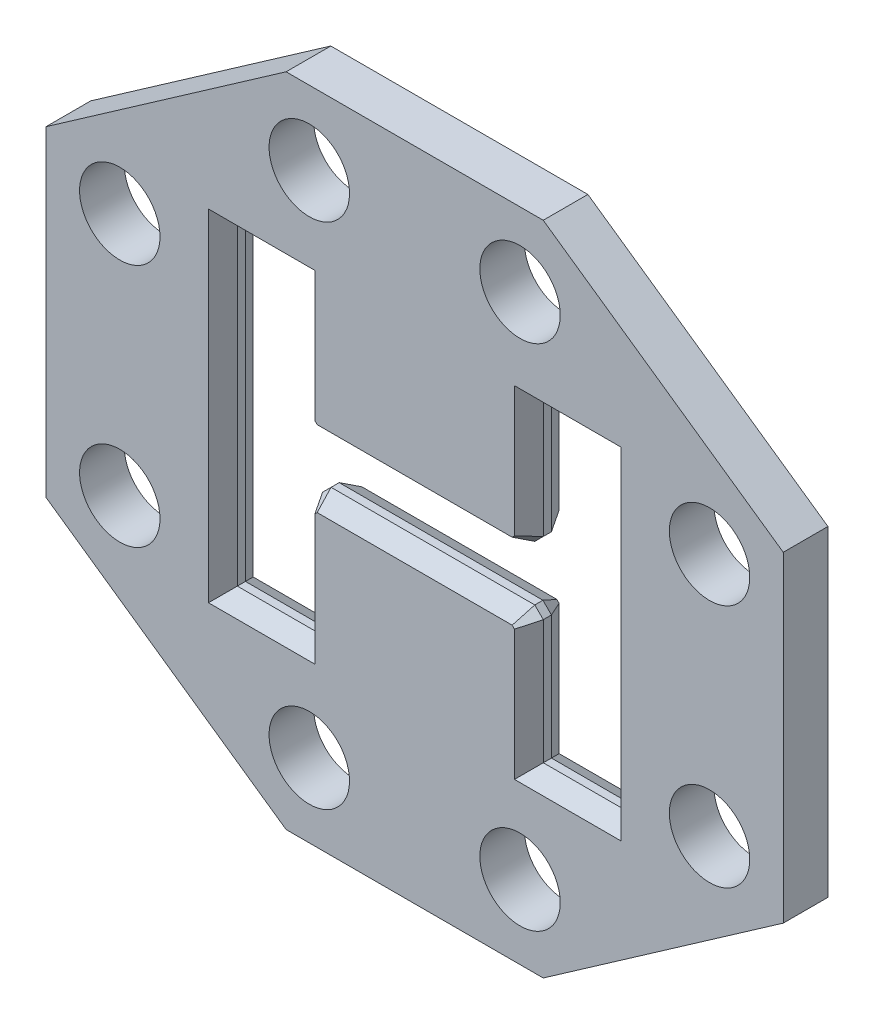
ISO-10303-21;
HEADER;
FILE_DESCRIPTION(('STEP AP214'),'2;1');
FILE_NAME('part.step','',(''),(''),'','','');
FILE_SCHEMA(('AUTOMOTIVE_DESIGN { 1 0 10303 214 1 1 1 1 }'));
ENDSEC;
DATA;
#1=APPLICATION_CONTEXT('core data for automotive mechanical design processes');
#2=APPLICATION_PROTOCOL_DEFINITION('international standard','automotive_design',2000,#1);
#3=PRODUCT_CONTEXT('',#1,'mechanical');
#4=PRODUCT('Part','Part','',(#3));
#5=PRODUCT_RELATED_PRODUCT_CATEGORY('part','',(#4));
#6=PRODUCT_DEFINITION_FORMATION('','',#4);
#7=PRODUCT_DEFINITION_CONTEXT('part definition',#1,'design');
#8=PRODUCT_DEFINITION('design','',#6,#7);
#9=PRODUCT_DEFINITION_SHAPE('','',#8);
#10=(LENGTH_UNIT() NAMED_UNIT(*) SI_UNIT(.MILLI.,.METRE.));
#11=(NAMED_UNIT(*) PLANE_ANGLE_UNIT() SI_UNIT($,.RADIAN.));
#12=(NAMED_UNIT(*) SI_UNIT($,.STERADIAN.) SOLID_ANGLE_UNIT());
#13=UNCERTAINTY_MEASURE_WITH_UNIT(LENGTH_MEASURE(1.E-05),#10,'distance_accuracy_value','');
#14=(GEOMETRIC_REPRESENTATION_CONTEXT(3) GLOBAL_UNCERTAINTY_ASSIGNED_CONTEXT((#13)) GLOBAL_UNIT_ASSIGNED_CONTEXT((#10,
#11,#12)) REPRESENTATION_CONTEXT('',''));
#15=CARTESIAN_POINT('',(0.,0.,0.));
#16=DIRECTION('',(0.,0.,1.));
#17=DIRECTION('',(1.,0.,0.));
#18=AXIS2_PLACEMENT_3D('',#15,#16,#17);
#19=CARTESIAN_POINT('',(156.845,-230.378,31.75));
#20=DIRECTION('',(1.,0.,0.));
#21=DIRECTION('',(0.,0.,-1.));
#22=AXIS2_PLACEMENT_3D('',#19,#20,#21);
#23=PLANE('',#22);
#24=DIRECTION('',(0.,0.,-1.));
#25=VECTOR('',#24,1.);
#26=CARTESIAN_POINT('',(156.845,-227.33,31.75));
#27=LINE('',#26,#25);
#28=CARTESIAN_POINT('',(156.845,-227.33,5.76923788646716));
#29=VERTEX_POINT('',#28);
#30=CARTESIAN_POINT('',(156.845,-227.33,-5.76923788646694));
#31=VERTEX_POINT('',#30);
#32=EDGE_CURVE('E704',#29,#31,#27,.T.);
#33=ORIENTED_EDGE('',*,*,#32,.T.);
#34=DIRECTION('',(0.,1.,0.));
#35=VECTOR('',#34,1.);
#36=CARTESIAN_POINT('',(156.845,-230.378,-5.76923788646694));
#37=LINE('',#36,#35);
#38=CARTESIAN_POINT('',(156.845,-51.1810000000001,-5.76923788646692));
#39=VERTEX_POINT('',#38);
#40=EDGE_CURVE('E58',#31,#39,#37,.T.);
#41=ORIENTED_EDGE('',*,*,#40,.T.);
#42=DIRECTION('',(0.,0.,-1.));
#43=VECTOR('',#42,1.);
#44=CARTESIAN_POINT('',(156.845,-51.1810000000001,31.75));
#45=LINE('',#44,#43);
#46=CARTESIAN_POINT('',(156.845,-51.1810000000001,5.76923788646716));
#47=VERTEX_POINT('',#46);
#48=EDGE_CURVE('E709',#47,#39,#45,.T.);
#49=ORIENTED_EDGE('',*,*,#48,.F.);
#50=DIRECTION('',(0.,-1.,0.));
#51=VECTOR('',#50,1.);
#52=CARTESIAN_POINT('',(156.845,-227.33,5.76923788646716));
#53=LINE('',#52,#51);
#54=EDGE_CURVE('E439',#47,#29,#53,.T.);
#55=ORIENTED_EDGE('',*,*,#54,.T.);
#56=EDGE_LOOP('',(#33,#41,#49,#55));
#57=FACE_BOUND('',#56,.T.);
#58=ADVANCED_FACE('F47',(#57),#23,.T.);
#59=CARTESIAN_POINT('',(-156.845,230.378,31.75));
#60=DIRECTION('',(-1.,0.,0.));
#61=DIRECTION('',(0.,0.,1.));
#62=AXIS2_PLACEMENT_3D('',#59,#60,#61);
#63=PLANE('',#62);
#64=DIRECTION('',(0.,0.,-1.));
#65=VECTOR('',#64,1.);
#66=CARTESIAN_POINT('',(-156.845,227.33,31.75));
#67=LINE('',#66,#65);
#68=CARTESIAN_POINT('',(-156.845,227.33,5.76923788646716));
#69=VERTEX_POINT('',#68);
#70=CARTESIAN_POINT('',(-156.845,227.33,-5.76923788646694));
#71=VERTEX_POINT('',#70);
#72=EDGE_CURVE('E1578',#69,#71,#67,.T.);
#73=ORIENTED_EDGE('',*,*,#72,.T.);
#74=DIRECTION('',(0.,-1.,0.));
#75=VECTOR('',#74,1.);
#76=CARTESIAN_POINT('',(-156.845,230.378,-5.76923788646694));
#77=LINE('',#76,#75);
#78=CARTESIAN_POINT('',(-156.845,51.1809999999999,-5.76923788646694));
#79=VERTEX_POINT('',#78);
#80=EDGE_CURVE('E573',#71,#79,#77,.T.);
#81=ORIENTED_EDGE('',*,*,#80,.T.);
#82=DIRECTION('',(0.,0.,-1.));
#83=VECTOR('',#82,1.);
#84=CARTESIAN_POINT('',(-156.845,51.1809999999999,31.75));
#85=LINE('',#84,#83);
#86=CARTESIAN_POINT('',(-156.845,51.1809999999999,5.76923788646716));
#87=VERTEX_POINT('',#86);
#88=EDGE_CURVE('E691',#87,#79,#85,.T.);
#89=ORIENTED_EDGE('',*,*,#88,.F.);
#90=DIRECTION('',(0.,1.,0.));
#91=VECTOR('',#90,1.);
#92=CARTESIAN_POINT('',(-156.845,227.33,5.76923788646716));
#93=LINE('',#92,#91);
#94=EDGE_CURVE('E418',#87,#69,#93,.T.);
#95=ORIENTED_EDGE('',*,*,#94,.T.);
#96=EDGE_LOOP('',(#73,#81,#89,#95));
#97=FACE_BOUND('',#96,.T.);
#98=ADVANCED_FACE('F804',(#97),#63,.T.);
#99=CARTESIAN_POINT('',(0.,0.,31.75));
#100=DIRECTION('',(0.,0.,-1.));
#101=DIRECTION('',(-1.,0.,0.));
#102=AXIS2_PLACEMENT_3D('',#99,#100,#101);
#103=PLANE('',#102);
#104=DIRECTION('',(0.,-1.,0.));
#105=VECTOR('',#104,1.);
#106=CARTESIAN_POINT('',(293.003,-227.33,31.75));
#107=LINE('',#106,#105);
#108=CARTESIAN_POINT('',(293.003,242.33,31.75));
#109=VERTEX_POINT('',#108);
#110=CARTESIAN_POINT('',(293.003,-242.33,31.75));
#111=VERTEX_POINT('',#110);
#112=EDGE_CURVE('E392',#109,#111,#107,.T.);
#113=ORIENTED_EDGE('',*,*,#112,.T.);
#114=DIRECTION('',(-1.,0.,0.));
#115=VECTOR('',#114,1.);
#116=CARTESIAN_POINT('',(156.845,-242.33,31.75));
#117=LINE('',#116,#115);
#118=CARTESIAN_POINT('',(141.845,-242.33,31.75));
#119=VERTEX_POINT('',#118);
#120=EDGE_CURVE('E391',#111,#119,#117,.T.);
#121=ORIENTED_EDGE('',*,*,#120,.T.);
#122=DIRECTION('',(0.,1.,0.));
#123=VECTOR('',#122,1.);
#124=CARTESIAN_POINT('',(141.845,-51.1810000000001,31.75));
#125=LINE('',#124,#123);
#126=CARTESIAN_POINT('',(141.845,-57.3942034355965,31.75));
#127=VERTEX_POINT('',#126);
#128=EDGE_CURVE('E343',#119,#127,#125,.T.);
#129=ORIENTED_EDGE('',*,*,#128,.T.);
#130=DIRECTION('',(-0.707106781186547,0.707106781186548,0.));
#131=VECTOR('',#130,1.);
#132=CARTESIAN_POINT('',(134.173398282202,-49.7226017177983,31.75));
#133=LINE('',#132,#131);
#134=CARTESIAN_POINT('',(138.566796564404,-54.1160000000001,31.75));
#135=VERTEX_POINT('',#134);
#136=EDGE_CURVE('E354',#127,#135,#133,.T.);
#137=ORIENTED_EDGE('',*,*,#136,.T.);
#138=DIRECTION('',(-1.,0.,0.));
#139=VECTOR('',#138,1.);
#140=CARTESIAN_POINT('',(-144.78,-54.1160000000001,31.75));
#141=LINE('',#140,#139);
#142=CARTESIAN_POINT('',(-138.566796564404,-54.1160000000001,31.75));
#143=VERTEX_POINT('',#142);
#144=EDGE_CURVE('E351',#135,#143,#141,.T.);
#145=ORIENTED_EDGE('',*,*,#144,.T.);
#146=DIRECTION('',(-0.707106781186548,-0.707106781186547,0.));
#147=VECTOR('',#146,1.);
#148=CARTESIAN_POINT('',(-146.238398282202,-61.7876017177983,31.75));
#149=LINE('',#148,#147);
#150=CARTESIAN_POINT('',(-141.845,-57.3942034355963,31.75));
#151=VERTEX_POINT('',#150);
#152=EDGE_CURVE('E356',#143,#151,#149,.T.);
#153=ORIENTED_EDGE('',*,*,#152,.T.);
#154=DIRECTION('',(0.,-1.,0.));
#155=VECTOR('',#154,1.);
#156=CARTESIAN_POINT('',(-141.845,-227.33,31.75));
#157=LINE('',#156,#155);
#158=CARTESIAN_POINT('',(-141.845,-242.33,31.75));
#159=VERTEX_POINT('',#158);
#160=EDGE_CURVE('E363',#151,#159,#157,.T.);
#161=ORIENTED_EDGE('',*,*,#160,.T.);
#162=DIRECTION('',(-1.,0.,0.));
#163=VECTOR('',#162,1.);
#164=CARTESIAN_POINT('',(-278.003,-242.33,31.75));
#165=LINE('',#164,#163);
#166=CARTESIAN_POINT('',(-293.003,-242.33,31.75));
#167=VERTEX_POINT('',#166);
#168=EDGE_CURVE('E364',#159,#167,#165,.T.);
#169=ORIENTED_EDGE('',*,*,#168,.T.);
#170=DIRECTION('',(0.,1.,0.));
#171=VECTOR('',#170,1.);
#172=CARTESIAN_POINT('',(-293.003,227.33,31.75));
#173=LINE('',#172,#171);
#174=CARTESIAN_POINT('',(-293.003,242.33,31.75));
#175=VERTEX_POINT('',#174);
#176=EDGE_CURVE('E370',#167,#175,#173,.T.);
#177=ORIENTED_EDGE('',*,*,#176,.T.);
#178=DIRECTION('',(1.,0.,0.));
#179=VECTOR('',#178,1.);
#180=CARTESIAN_POINT('',(-156.845,242.33,31.75));
#181=LINE('',#180,#179);
#182=CARTESIAN_POINT('',(-141.845,242.33,31.75));
#183=VERTEX_POINT('',#182);
#184=EDGE_CURVE('E369',#175,#183,#181,.T.);
#185=ORIENTED_EDGE('',*,*,#184,.T.);
#186=DIRECTION('',(0.,-1.,0.));
#187=VECTOR('',#186,1.);
#188=CARTESIAN_POINT('',(-141.845,51.1809999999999,31.75));
#189=LINE('',#188,#187);
#190=CARTESIAN_POINT('',(-141.845,57.3942034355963,31.75));
#191=VERTEX_POINT('',#190);
#192=EDGE_CURVE('E373',#183,#191,#189,.T.);
#193=ORIENTED_EDGE('',*,*,#192,.T.);
#194=DIRECTION('',(0.707106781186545,-0.70710678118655,0.));
#195=VECTOR('',#194,1.);
#196=CARTESIAN_POINT('',(-134.173398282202,49.7226017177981,31.75));
#197=LINE('',#196,#195);
#198=CARTESIAN_POINT('',(-138.566796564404,54.116,31.75));
#199=VERTEX_POINT('',#198);
#200=EDGE_CURVE('E376',#191,#199,#197,.T.);
#201=ORIENTED_EDGE('',*,*,#200,.T.);
#202=DIRECTION('',(1.,0.,0.));
#203=VECTOR('',#202,1.);
#204=CARTESIAN_POINT('',(144.78,54.116,31.75));
#205=LINE('',#204,#203);
#206=CARTESIAN_POINT('',(138.566796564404,54.116,31.75));
#207=VERTEX_POINT('',#206);
#208=EDGE_CURVE('E378',#199,#207,#205,.T.);
#209=ORIENTED_EDGE('',*,*,#208,.T.);
#210=DIRECTION('',(0.707106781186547,0.707106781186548,0.));
#211=VECTOR('',#210,1.);
#212=CARTESIAN_POINT('',(146.238398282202,61.7876017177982,31.75));
#213=LINE('',#212,#211);
#214=CARTESIAN_POINT('',(141.845,57.3942034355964,31.75));
#215=VERTEX_POINT('',#214);
#216=EDGE_CURVE('E385',#207,#215,#213,.T.);
#217=ORIENTED_EDGE('',*,*,#216,.T.);
#218=DIRECTION('',(0.,1.,0.));
#219=VECTOR('',#218,1.);
#220=CARTESIAN_POINT('',(141.845,227.33,31.75));
#221=LINE('',#220,#219);
#222=CARTESIAN_POINT('',(141.845,242.33,31.75));
#223=VERTEX_POINT('',#222);
#224=EDGE_CURVE('E383',#215,#223,#221,.T.);
#225=ORIENTED_EDGE('',*,*,#224,.T.);
#226=DIRECTION('',(1.,0.,0.));
#227=VECTOR('',#226,1.);
#228=CARTESIAN_POINT('',(278.003,242.33,31.75));
#229=LINE('',#228,#227);
#230=EDGE_CURVE('E390',#223,#109,#229,.T.);
#231=ORIENTED_EDGE('',*,*,#230,.T.);
#232=EDGE_LOOP('',(#113,#121,#129,#137,#145,#153,#161,#169,#177,#185,#193,#201,#209,#217,#225,#231));
#233=FACE_BOUND('',#232,.T.);
#234=CARTESIAN_POINT('',(-149.758610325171,-361.549268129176,31.75));
#235=DIRECTION('',(0.,0.,1.));
#236=DIRECTION('',(1.,0.,0.));
#237=AXIS2_PLACEMENT_3D('',#234,#235,#236);
#238=CIRCLE('',#237,57.15);
#239=CARTESIAN_POINT('',(-92.6086103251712,-361.549268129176,31.75));
#240=VERTEX_POINT('',#239);
#241=EDGE_CURVE('E1633',#240,#240,#238,.T.);
#242=ORIENTED_EDGE('',*,*,#241,.F.);
#243=EDGE_LOOP('',(#242));
#244=FACE_BOUND('',#243,.T.);
#245=CARTESIAN_POINT('',(149.758610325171,-361.549268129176,31.75));
#246=DIRECTION('',(0.,0.,1.));
#247=DIRECTION('',(1.,0.,0.));
#248=AXIS2_PLACEMENT_3D('',#245,#246,#247);
#249=CIRCLE('',#248,57.15);
#250=CARTESIAN_POINT('',(206.908610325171,-361.549268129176,31.75));
#251=VERTEX_POINT('',#250);
#252=EDGE_CURVE('E1639',#251,#251,#249,.T.);
#253=ORIENTED_EDGE('',*,*,#252,.F.);
#254=EDGE_LOOP('',(#253));
#255=FACE_BOUND('',#254,.T.);
#256=CARTESIAN_POINT('',(419.080268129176,-173.588730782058,31.75));
#257=DIRECTION('',(0.,0.,1.));
#258=DIRECTION('',(1.,0.,0.));
#259=AXIS2_PLACEMENT_3D('',#256,#257,#258);
#260=CIRCLE('',#259,57.15);
#261=CARTESIAN_POINT('',(476.230268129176,-173.588730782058,31.75));
#262=VERTEX_POINT('',#261);
#263=EDGE_CURVE('E1649',#262,#262,#260,.T.);
#264=ORIENTED_EDGE('',*,*,#263,.F.);
#265=EDGE_LOOP('',(#264));
#266=FACE_BOUND('',#265,.T.);
#267=CARTESIAN_POINT('',(419.080268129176,173.588730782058,31.75));
#268=DIRECTION('',(0.,0.,1.));
#269=DIRECTION('',(1.,0.,0.));
#270=AXIS2_PLACEMENT_3D('',#267,#268,#269);
#271=CIRCLE('',#270,57.15);
#272=CARTESIAN_POINT('',(476.230268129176,173.588730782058,31.75));
#273=VERTEX_POINT('',#272);
#274=EDGE_CURVE('E1651',#273,#273,#271,.T.);
#275=ORIENTED_EDGE('',*,*,#274,.F.);
#276=EDGE_LOOP('',(#275));
#277=FACE_BOUND('',#276,.T.);
#278=CARTESIAN_POINT('',(149.758610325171,361.549268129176,31.75));
#279=DIRECTION('',(0.,0.,1.));
#280=DIRECTION('',(1.,0.,0.));
#281=AXIS2_PLACEMENT_3D('',#278,#279,#280);
#282=CIRCLE('',#281,57.15);
#283=CARTESIAN_POINT('',(206.908610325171,361.549268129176,31.75));
#284=VERTEX_POINT('',#283);
#285=EDGE_CURVE('E1661',#284,#284,#282,.T.);
#286=ORIENTED_EDGE('',*,*,#285,.F.);
#287=EDGE_LOOP('',(#286));
#288=FACE_BOUND('',#287,.T.);
#289=CARTESIAN_POINT('',(-149.758610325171,361.549268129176,31.75));
#290=DIRECTION('',(0.,0.,1.));
#291=DIRECTION('',(1.,0.,0.));
#292=AXIS2_PLACEMENT_3D('',#289,#290,#291);
#293=CIRCLE('',#292,57.15);
#294=CARTESIAN_POINT('',(-92.6086103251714,361.549268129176,31.75));
#295=VERTEX_POINT('',#294);
#296=EDGE_CURVE('E1671',#295,#295,#293,.T.);
#297=ORIENTED_EDGE('',*,*,#296,.F.);
#298=EDGE_LOOP('',(#297));
#299=FACE_BOUND('',#298,.T.);
#300=CARTESIAN_POINT('',(-419.080268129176,173.588730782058,31.75));
#301=DIRECTION('',(0.,0.,1.));
#302=DIRECTION('',(1.,0.,0.));
#303=AXIS2_PLACEMENT_3D('',#300,#301,#302);
#304=CIRCLE('',#303,57.15);
#305=CARTESIAN_POINT('',(-361.930268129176,173.588730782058,31.75));
#306=VERTEX_POINT('',#305);
#307=EDGE_CURVE('E1628',#306,#306,#304,.T.);
#308=ORIENTED_EDGE('',*,*,#307,.F.);
#309=EDGE_LOOP('',(#308));
#310=FACE_BOUND('',#309,.T.);
#311=CARTESIAN_POINT('',(-419.080268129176,-173.588730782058,31.75));
#312=DIRECTION('',(0.,0.,1.));
#313=DIRECTION('',(1.,0.,0.));
#314=AXIS2_PLACEMENT_3D('',#311,#312,#313);
#315=CIRCLE('',#314,57.15);
#316=CARTESIAN_POINT('',(-361.930268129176,-173.588730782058,31.75));
#317=VERTEX_POINT('',#316);
#318=EDGE_CURVE('E1627',#317,#317,#315,.T.);
#319=ORIENTED_EDGE('',*,*,#318,.F.);
#320=EDGE_LOOP('',(#319));
#321=FACE_BOUND('',#320,.T.);
#322=DIRECTION('',(0.,-1.,0.));
#323=VECTOR('',#322,1.);
#324=CARTESIAN_POINT('',(-523.855268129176,-228.234235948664,31.75));
#325=LINE('',#324,#323);
#326=CARTESIAN_POINT('',(-523.855268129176,228.234235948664,31.75));
#327=VERTEX_POINT('',#326);
#328=CARTESIAN_POINT('',(-523.855268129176,-228.234235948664,31.75));
#329=VERTEX_POINT('',#328);
#330=EDGE_CURVE('E325',#327,#329,#325,.T.);
#331=ORIENTED_EDGE('',*,*,#330,.T.);
#332=DIRECTION('',(0.820038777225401,-0.572307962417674,0.));
#333=VECTOR('',#332,1.);
#334=CARTESIAN_POINT('',(-182.70492307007,-466.324268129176,31.75));
#335=LINE('',#334,#333);
#336=CARTESIAN_POINT('',(-182.70492307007,-466.324268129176,31.75));
#337=VERTEX_POINT('',#336);
#338=EDGE_CURVE('E311',#329,#337,#335,.T.);
#339=ORIENTED_EDGE('',*,*,#338,.T.);
#340=DIRECTION('',(1.,0.,0.));
#341=VECTOR('',#340,1.);
#342=CARTESIAN_POINT('',(182.70492307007,-466.324268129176,31.75));
#343=LINE('',#342,#341);
#344=CARTESIAN_POINT('',(182.70492307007,-466.324268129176,31.75));
#345=VERTEX_POINT('',#344);
#346=EDGE_CURVE('E321',#337,#345,#343,.T.);
#347=ORIENTED_EDGE('',*,*,#346,.T.);
#348=DIRECTION('',(0.820038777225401,0.572307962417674,0.));
#349=VECTOR('',#348,1.);
#350=CARTESIAN_POINT('',(523.855268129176,-228.234235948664,31.75));
#351=LINE('',#350,#349);
#352=CARTESIAN_POINT('',(523.855268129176,-228.234235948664,31.75));
#353=VERTEX_POINT('',#352);
#354=EDGE_CURVE('E715',#345,#353,#351,.T.);
#355=ORIENTED_EDGE('',*,*,#354,.T.);
#356=DIRECTION('',(0.,1.,0.));
#357=VECTOR('',#356,1.);
#358=CARTESIAN_POINT('',(523.855268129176,228.234235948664,31.75));
#359=LINE('',#358,#357);
#360=CARTESIAN_POINT('',(523.855268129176,228.234235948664,31.75));
#361=VERTEX_POINT('',#360);
#362=EDGE_CURVE('E717',#353,#361,#359,.T.);
#363=ORIENTED_EDGE('',*,*,#362,.T.);
#364=DIRECTION('',(-0.820038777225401,0.572307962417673,0.));
#365=VECTOR('',#364,1.);
#366=CARTESIAN_POINT('',(182.70492307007,466.324268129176,31.75));
#367=LINE('',#366,#365);
#368=CARTESIAN_POINT('',(182.70492307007,466.324268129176,31.75));
#369=VERTEX_POINT('',#368);
#370=EDGE_CURVE('E716',#361,#369,#367,.T.);
#371=ORIENTED_EDGE('',*,*,#370,.T.);
#372=DIRECTION('',(-1.,0.,0.));
#373=VECTOR('',#372,1.);
#374=CARTESIAN_POINT('',(-182.704923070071,466.324268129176,31.75));
#375=LINE('',#374,#373);
#376=CARTESIAN_POINT('',(-182.704923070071,466.324268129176,31.75));
#377=VERTEX_POINT('',#376);
#378=EDGE_CURVE('E724',#369,#377,#375,.T.);
#379=ORIENTED_EDGE('',*,*,#378,.T.);
#380=DIRECTION('',(-0.8200387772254,-0.572307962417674,0.));
#381=VECTOR('',#380,1.);
#382=CARTESIAN_POINT('',(-523.855268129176,228.234235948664,31.75));
#383=LINE('',#382,#381);
#384=EDGE_CURVE('E330',#377,#327,#383,.T.);
#385=ORIENTED_EDGE('',*,*,#384,.T.);
#386=EDGE_LOOP('',(#331,#339,#347,#355,#363,#371,#379,#385));
#387=FACE_BOUND('',#386,.T.);
#388=ADVANCED_FACE('F327',(#233,#244,#255,#266,#277,#288,#299,#310,#321,#387),#103,.F.);
#389=CARTESIAN_POINT('',(0.,0.,-31.75));
#390=DIRECTION('',(0.,0.,-1.));
#391=DIRECTION('',(-1.,0.,0.));
#392=AXIS2_PLACEMENT_3D('',#389,#390,#391);
#393=PLANE('',#392);
#394=DIRECTION('',(0.707106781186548,0.707106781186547,0.));
#395=VECTOR('',#394,1.);
#396=CARTESIAN_POINT('',(-42.2253982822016,42.2253982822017,-31.75));
#397=LINE('',#396,#395);
#398=CARTESIAN_POINT('',(-141.845,-57.3942034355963,-31.75));
#399=VERTEX_POINT('',#398);
#400=CARTESIAN_POINT('',(-138.566796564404,-54.1160000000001,-31.75));
#401=VERTEX_POINT('',#400);
#402=EDGE_CURVE('E547',#399,#401,#397,.T.);
#403=ORIENTED_EDGE('',*,*,#402,.T.);
#404=DIRECTION('',(1.,0.,0.));
#405=VECTOR('',#404,1.);
#406=CARTESIAN_POINT('',(0.,-54.1160000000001,-31.75));
#407=LINE('',#406,#405);
#408=CARTESIAN_POINT('',(138.566796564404,-54.1160000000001,-31.75));
#409=VERTEX_POINT('',#408);
#410=EDGE_CURVE('E553',#401,#409,#407,.T.);
#411=ORIENTED_EDGE('',*,*,#410,.T.);
#412=DIRECTION('',(0.707106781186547,-0.707106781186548,0.));
#413=VECTOR('',#412,1.);
#414=CARTESIAN_POINT('',(42.2253982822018,42.2253982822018,-31.75));
#415=LINE('',#414,#413);
#416=CARTESIAN_POINT('',(141.845,-57.3942034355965,-31.75));
#417=VERTEX_POINT('',#416);
#418=EDGE_CURVE('E442',#409,#417,#415,.T.);
#419=ORIENTED_EDGE('',*,*,#418,.T.);
#420=DIRECTION('',(0.,-1.,0.));
#421=VECTOR('',#420,1.);
#422=CARTESIAN_POINT('',(141.845,0.,-31.75));
#423=LINE('',#422,#421);
#424=CARTESIAN_POINT('',(141.845,-242.33,-31.75));
#425=VERTEX_POINT('',#424);
#426=EDGE_CURVE('E508',#417,#425,#423,.T.);
#427=ORIENTED_EDGE('',*,*,#426,.T.);
#428=DIRECTION('',(1.,0.,0.));
#429=VECTOR('',#428,1.);
#430=CARTESIAN_POINT('',(0.,-242.33,-31.75));
#431=LINE('',#430,#429);
#432=CARTESIAN_POINT('',(293.003,-242.33,-31.75));
#433=VERTEX_POINT('',#432);
#434=EDGE_CURVE('E515',#425,#433,#431,.T.);
#435=ORIENTED_EDGE('',*,*,#434,.T.);
#436=DIRECTION('',(0.,1.,0.));
#437=VECTOR('',#436,1.);
#438=CARTESIAN_POINT('',(293.003,0.,-31.75));
#439=LINE('',#438,#437);
#440=CARTESIAN_POINT('',(293.003,242.33,-31.75));
#441=VERTEX_POINT('',#440);
#442=EDGE_CURVE('E513',#433,#441,#439,.T.);
#443=ORIENTED_EDGE('',*,*,#442,.T.);
#444=DIRECTION('',(-1.,0.,0.));
#445=VECTOR('',#444,1.);
#446=CARTESIAN_POINT('',(0.,242.33,-31.75));
#447=LINE('',#446,#445);
#448=CARTESIAN_POINT('',(141.845,242.33,-31.75));
#449=VERTEX_POINT('',#448);
#450=EDGE_CURVE('E520',#441,#449,#447,.T.);
#451=ORIENTED_EDGE('',*,*,#450,.T.);
#452=DIRECTION('',(0.,-1.,0.));
#453=VECTOR('',#452,1.);
#454=CARTESIAN_POINT('',(141.845,0.,-31.75));
#455=LINE('',#454,#453);
#456=CARTESIAN_POINT('',(141.845,57.3942034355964,-31.75));
#457=VERTEX_POINT('',#456);
#458=EDGE_CURVE('E522',#449,#457,#455,.T.);
#459=ORIENTED_EDGE('',*,*,#458,.T.);
#460=DIRECTION('',(-0.707106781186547,-0.707106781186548,0.));
#461=VECTOR('',#460,1.);
#462=CARTESIAN_POINT('',(42.2253982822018,-42.2253982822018,-31.75));
#463=LINE('',#462,#461);
#464=CARTESIAN_POINT('',(138.566796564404,54.116,-31.75));
#465=VERTEX_POINT('',#464);
#466=EDGE_CURVE('E521',#457,#465,#463,.T.);
#467=ORIENTED_EDGE('',*,*,#466,.T.);
#468=DIRECTION('',(-1.,0.,0.));
#469=VECTOR('',#468,1.);
#470=CARTESIAN_POINT('',(0.,54.116,-31.75));
#471=LINE('',#470,#469);
#472=CARTESIAN_POINT('',(-138.566796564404,54.116,-31.75));
#473=VERTEX_POINT('',#472);
#474=EDGE_CURVE('E529',#465,#473,#471,.T.);
#475=ORIENTED_EDGE('',*,*,#474,.T.);
#476=DIRECTION('',(-0.707106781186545,0.70710678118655,0.));
#477=VECTOR('',#476,1.);
#478=CARTESIAN_POINT('',(-42.2253982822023,-42.225398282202,-31.75));
#479=LINE('',#478,#477);
#480=CARTESIAN_POINT('',(-141.845,57.3942034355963,-31.75));
#481=VERTEX_POINT('',#480);
#482=EDGE_CURVE('E526',#473,#481,#479,.T.);
#483=ORIENTED_EDGE('',*,*,#482,.T.);
#484=DIRECTION('',(0.,1.,0.));
#485=VECTOR('',#484,1.);
#486=CARTESIAN_POINT('',(-141.845,0.,-31.75));
#487=LINE('',#486,#485);
#488=CARTESIAN_POINT('',(-141.845,242.33,-31.75));
#489=VERTEX_POINT('',#488);
#490=EDGE_CURVE('E531',#481,#489,#487,.T.);
#491=ORIENTED_EDGE('',*,*,#490,.T.);
#492=DIRECTION('',(-1.,0.,0.));
#493=VECTOR('',#492,1.);
#494=CARTESIAN_POINT('',(0.,242.33,-31.75));
#495=LINE('',#494,#493);
#496=CARTESIAN_POINT('',(-293.003,242.33,-31.75));
#497=VERTEX_POINT('',#496);
#498=EDGE_CURVE('E539',#489,#497,#495,.T.);
#499=ORIENTED_EDGE('',*,*,#498,.T.);
#500=DIRECTION('',(0.,-1.,0.));
#501=VECTOR('',#500,1.);
#502=CARTESIAN_POINT('',(-293.003,0.,-31.75));
#503=LINE('',#502,#501);
#504=CARTESIAN_POINT('',(-293.003,-242.33,-31.75));
#505=VERTEX_POINT('',#504);
#506=EDGE_CURVE('E538',#497,#505,#503,.T.);
#507=ORIENTED_EDGE('',*,*,#506,.T.);
#508=DIRECTION('',(1.,0.,0.));
#509=VECTOR('',#508,1.);
#510=CARTESIAN_POINT('',(0.,-242.33,-31.75));
#511=LINE('',#510,#509);
#512=CARTESIAN_POINT('',(-141.845,-242.33,-31.75));
#513=VERTEX_POINT('',#512);
#514=EDGE_CURVE('E544',#505,#513,#511,.T.);
#515=ORIENTED_EDGE('',*,*,#514,.T.);
#516=DIRECTION('',(0.,1.,0.));
#517=VECTOR('',#516,1.);
#518=CARTESIAN_POINT('',(-141.845,0.,-31.75));
#519=LINE('',#518,#517);
#520=EDGE_CURVE('E543',#513,#399,#519,.T.);
#521=ORIENTED_EDGE('',*,*,#520,.T.);
#522=EDGE_LOOP('',(#403,#411,#419,#427,#435,#443,#451,#459,#467,#475,#483,#491,#499,#507,#515,#521));
#523=FACE_BOUND('',#522,.T.);
#524=CARTESIAN_POINT('',(-149.758610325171,-361.549268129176,-31.75));
#525=DIRECTION('',(0.,0.,1.));
#526=DIRECTION('',(1.,0.,0.));
#527=AXIS2_PLACEMENT_3D('',#524,#525,#526);
#528=CIRCLE('',#527,57.15);
#529=CARTESIAN_POINT('',(-92.6086103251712,-361.549268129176,-31.75));
#530=VERTEX_POINT('',#529);
#531=EDGE_CURVE('E506',#530,#530,#528,.T.);
#532=ORIENTED_EDGE('',*,*,#531,.T.);
#533=EDGE_LOOP('',(#532));
#534=FACE_BOUND('',#533,.T.);
#535=CARTESIAN_POINT('',(149.758610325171,-361.549268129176,-31.75));
#536=DIRECTION('',(0.,0.,1.));
#537=DIRECTION('',(1.,0.,0.));
#538=AXIS2_PLACEMENT_3D('',#535,#536,#537);
#539=CIRCLE('',#538,57.15);
#540=CARTESIAN_POINT('',(206.908610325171,-361.549268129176,-31.75));
#541=VERTEX_POINT('',#540);
#542=EDGE_CURVE('E1631',#541,#541,#539,.T.);
#543=ORIENTED_EDGE('',*,*,#542,.T.);
#544=EDGE_LOOP('',(#543));
#545=FACE_BOUND('',#544,.T.);
#546=CARTESIAN_POINT('',(419.080268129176,-173.588730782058,-31.75));
#547=DIRECTION('',(0.,0.,1.));
#548=DIRECTION('',(1.,0.,0.));
#549=AXIS2_PLACEMENT_3D('',#546,#547,#548);
#550=CIRCLE('',#549,57.15);
#551=CARTESIAN_POINT('',(476.230268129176,-173.588730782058,-31.75));
#552=VERTEX_POINT('',#551);
#553=EDGE_CURVE('E1645',#552,#552,#550,.T.);
#554=ORIENTED_EDGE('',*,*,#553,.T.);
#555=EDGE_LOOP('',(#554));
#556=FACE_BOUND('',#555,.T.);
#557=CARTESIAN_POINT('',(419.080268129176,173.588730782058,-31.75));
#558=DIRECTION('',(0.,0.,1.));
#559=DIRECTION('',(1.,0.,0.));
#560=AXIS2_PLACEMENT_3D('',#557,#558,#559);
#561=CIRCLE('',#560,57.15);
#562=CARTESIAN_POINT('',(476.230268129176,173.588730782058,-31.75));
#563=VERTEX_POINT('',#562);
#564=EDGE_CURVE('E1653',#563,#563,#561,.T.);
#565=ORIENTED_EDGE('',*,*,#564,.T.);
#566=EDGE_LOOP('',(#565));
#567=FACE_BOUND('',#566,.T.);
#568=CARTESIAN_POINT('',(149.758610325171,361.549268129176,-31.75));
#569=DIRECTION('',(0.,0.,1.));
#570=DIRECTION('',(1.,0.,0.));
#571=AXIS2_PLACEMENT_3D('',#568,#569,#570);
#572=CIRCLE('',#571,57.15);
#573=CARTESIAN_POINT('',(206.908610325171,361.549268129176,-31.75));
#574=VERTEX_POINT('',#573);
#575=EDGE_CURVE('E1660',#574,#574,#572,.T.);
#576=ORIENTED_EDGE('',*,*,#575,.T.);
#577=EDGE_LOOP('',(#576));
#578=FACE_BOUND('',#577,.T.);
#579=CARTESIAN_POINT('',(-149.758610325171,361.549268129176,-31.75));
#580=DIRECTION('',(0.,0.,1.));
#581=DIRECTION('',(1.,0.,0.));
#582=AXIS2_PLACEMENT_3D('',#579,#580,#581);
#583=CIRCLE('',#582,57.15);
#584=CARTESIAN_POINT('',(-92.6086103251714,361.549268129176,-31.75));
#585=VERTEX_POINT('',#584);
#586=EDGE_CURVE('E1670',#585,#585,#583,.T.);
#587=ORIENTED_EDGE('',*,*,#586,.T.);
#588=EDGE_LOOP('',(#587));
#589=FACE_BOUND('',#588,.T.);
#590=CARTESIAN_POINT('',(-419.080268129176,173.588730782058,-31.75));
#591=DIRECTION('',(0.,0.,1.));
#592=DIRECTION('',(1.,0.,0.));
#593=AXIS2_PLACEMENT_3D('',#590,#591,#592);
#594=CIRCLE('',#593,57.15);
#595=CARTESIAN_POINT('',(-361.930268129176,173.588730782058,-31.75));
#596=VERTEX_POINT('',#595);
#597=EDGE_CURVE('E1674',#596,#596,#594,.T.);
#598=ORIENTED_EDGE('',*,*,#597,.T.);
#599=EDGE_LOOP('',(#598));
#600=FACE_BOUND('',#599,.T.);
#601=CARTESIAN_POINT('',(-419.080268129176,-173.588730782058,-31.75));
#602=DIRECTION('',(0.,0.,1.));
#603=DIRECTION('',(1.,0.,0.));
#604=AXIS2_PLACEMENT_3D('',#601,#602,#603);
#605=CIRCLE('',#604,57.15);
#606=CARTESIAN_POINT('',(-361.930268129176,-173.588730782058,-31.75));
#607=VERTEX_POINT('',#606);
#608=EDGE_CURVE('E1621',#607,#607,#605,.T.);
#609=ORIENTED_EDGE('',*,*,#608,.T.);
#610=EDGE_LOOP('',(#609));
#611=FACE_BOUND('',#610,.T.);
#612=DIRECTION('',(0.,-1.,0.));
#613=VECTOR('',#612,1.);
#614=CARTESIAN_POINT('',(-523.855268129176,-228.234235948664,-31.75));
#615=LINE('',#614,#613);
#616=CARTESIAN_POINT('',(-523.855268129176,228.234235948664,-31.75));
#617=VERTEX_POINT('',#616);
#618=CARTESIAN_POINT('',(-523.855268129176,-228.234235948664,-31.75));
#619=VERTEX_POINT('',#618);
#620=EDGE_CURVE('E340',#617,#619,#615,.T.);
#621=ORIENTED_EDGE('',*,*,#620,.F.);
#622=DIRECTION('',(-0.8200387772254,-0.572307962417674,0.));
#623=VECTOR('',#622,1.);
#624=CARTESIAN_POINT('',(-523.855268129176,228.234235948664,-31.75));
#625=LINE('',#624,#623);
#626=CARTESIAN_POINT('',(-182.704923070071,466.324268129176,-31.75));
#627=VERTEX_POINT('',#626);
#628=EDGE_CURVE('E332',#627,#617,#625,.T.);
#629=ORIENTED_EDGE('',*,*,#628,.F.);
#630=DIRECTION('',(-1.,0.,0.));
#631=VECTOR('',#630,1.);
#632=CARTESIAN_POINT('',(-182.704923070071,466.324268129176,-31.75));
#633=LINE('',#632,#631);
#634=CARTESIAN_POINT('',(182.70492307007,466.324268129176,-31.75));
#635=VERTEX_POINT('',#634);
#636=EDGE_CURVE('E741',#635,#627,#633,.T.);
#637=ORIENTED_EDGE('',*,*,#636,.F.);
#638=DIRECTION('',(-0.820038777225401,0.572307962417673,0.));
#639=VECTOR('',#638,1.);
#640=CARTESIAN_POINT('',(182.70492307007,466.324268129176,-31.75));
#641=LINE('',#640,#639);
#642=CARTESIAN_POINT('',(523.855268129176,228.234235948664,-31.75));
#643=VERTEX_POINT('',#642);
#644=EDGE_CURVE('E744',#643,#635,#641,.T.);
#645=ORIENTED_EDGE('',*,*,#644,.F.);
#646=DIRECTION('',(0.,1.,0.));
#647=VECTOR('',#646,1.);
#648=CARTESIAN_POINT('',(523.855268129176,228.234235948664,-31.75));
#649=LINE('',#648,#647);
#650=CARTESIAN_POINT('',(523.855268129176,-228.234235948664,-31.75));
#651=VERTEX_POINT('',#650);
#652=EDGE_CURVE('E736',#651,#643,#649,.T.);
#653=ORIENTED_EDGE('',*,*,#652,.F.);
#654=DIRECTION('',(0.820038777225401,0.572307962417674,0.));
#655=VECTOR('',#654,1.);
#656=CARTESIAN_POINT('',(523.855268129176,-228.234235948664,-31.75));
#657=LINE('',#656,#655);
#658=CARTESIAN_POINT('',(182.70492307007,-466.324268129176,-31.75));
#659=VERTEX_POINT('',#658);
#660=EDGE_CURVE('E737',#659,#651,#657,.T.);
#661=ORIENTED_EDGE('',*,*,#660,.F.);
#662=DIRECTION('',(1.,0.,0.));
#663=VECTOR('',#662,1.);
#664=CARTESIAN_POINT('',(182.70492307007,-466.324268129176,-31.75));
#665=LINE('',#664,#663);
#666=CARTESIAN_POINT('',(-182.70492307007,-466.324268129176,-31.75));
#667=VERTEX_POINT('',#666);
#668=EDGE_CURVE('E735',#667,#659,#665,.T.);
#669=ORIENTED_EDGE('',*,*,#668,.F.);
#670=DIRECTION('',(0.820038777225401,-0.572307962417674,0.));
#671=VECTOR('',#670,1.);
#672=CARTESIAN_POINT('',(-182.70492307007,-466.324268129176,-31.75));
#673=LINE('',#672,#671);
#674=EDGE_CURVE('E728',#619,#667,#673,.T.);
#675=ORIENTED_EDGE('',*,*,#674,.F.);
#676=EDGE_LOOP('',(#621,#629,#637,#645,#653,#661,#669,#675));
#677=FACE_BOUND('',#676,.T.);
#678=ADVANCED_FACE('F778',(#523,#534,#545,#556,#567,#578,#589,#600,#611,#677),#393,.T.);
#679=CARTESIAN_POINT('',(-523.855268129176,-228.234235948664,31.75));
#680=DIRECTION('',(1.,0.,0.));
#681=DIRECTION('',(0.,0.,-1.));
#682=AXIS2_PLACEMENT_3D('',#679,#680,#681);
#683=PLANE('',#682);
#684=ORIENTED_EDGE('',*,*,#620,.T.);
#685=DIRECTION('',(0.,0.,-1.));
#686=VECTOR('',#685,1.);
#687=CARTESIAN_POINT('',(-523.855268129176,-228.234235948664,31.75));
#688=LINE('',#687,#686);
#689=EDGE_CURVE('E314',#329,#619,#688,.T.);
#690=ORIENTED_EDGE('',*,*,#689,.F.);
#691=ORIENTED_EDGE('',*,*,#330,.F.);
#692=DIRECTION('',(0.,0.,-1.));
#693=VECTOR('',#692,1.);
#694=CARTESIAN_POINT('',(-523.855268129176,228.234235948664,31.75));
#695=LINE('',#694,#693);
#696=EDGE_CURVE('E730',#327,#617,#695,.T.);
#697=ORIENTED_EDGE('',*,*,#696,.T.);
#698=EDGE_LOOP('',(#684,#690,#691,#697));
#699=FACE_BOUND('',#698,.T.);
#700=ADVANCED_FACE('F331',(#699),#683,.F.);
#701=CARTESIAN_POINT('',(-182.70492307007,-466.324268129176,31.75));
#702=DIRECTION('',(0.572307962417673,0.820038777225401,0.));
#703=DIRECTION('',(-0.820038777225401,0.572307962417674,0.));
#704=AXIS2_PLACEMENT_3D('',#701,#702,#703);
#705=PLANE('',#704);
#706=ORIENTED_EDGE('',*,*,#674,.T.);
#707=DIRECTION('',(0.,0.,-1.));
#708=VECTOR('',#707,1.);
#709=CARTESIAN_POINT('',(-182.70492307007,-466.324268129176,31.75));
#710=LINE('',#709,#708);
#711=EDGE_CURVE('E319',#337,#667,#710,.T.);
#712=ORIENTED_EDGE('',*,*,#711,.F.);
#713=ORIENTED_EDGE('',*,*,#338,.F.);
#714=ORIENTED_EDGE('',*,*,#689,.T.);
#715=EDGE_LOOP('',(#706,#712,#713,#714));
#716=FACE_BOUND('',#715,.T.);
#717=ADVANCED_FACE('F312',(#716),#705,.F.);
#718=CARTESIAN_POINT('',(182.70492307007,-466.324268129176,31.75));
#719=DIRECTION('',(0.,1.,0.));
#720=DIRECTION('',(0.,0.,1.));
#721=AXIS2_PLACEMENT_3D('',#718,#719,#720);
#722=PLANE('',#721);
#723=ORIENTED_EDGE('',*,*,#668,.T.);
#724=DIRECTION('',(0.,0.,-1.));
#725=VECTOR('',#724,1.);
#726=CARTESIAN_POINT('',(182.70492307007,-466.324268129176,31.75));
#727=LINE('',#726,#725);
#728=EDGE_CURVE('E347',#345,#659,#727,.T.);
#729=ORIENTED_EDGE('',*,*,#728,.F.);
#730=ORIENTED_EDGE('',*,*,#346,.F.);
#731=ORIENTED_EDGE('',*,*,#711,.T.);
#732=EDGE_LOOP('',(#723,#729,#730,#731));
#733=FACE_BOUND('',#732,.T.);
#734=ADVANCED_FACE('F795',(#733),#722,.F.);
#735=CARTESIAN_POINT('',(523.855268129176,-228.234235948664,31.75));
#736=DIRECTION('',(-0.572307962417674,0.820038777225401,0.));
#737=DIRECTION('',(-0.820038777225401,-0.572307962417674,0.));
#738=AXIS2_PLACEMENT_3D('',#735,#736,#737);
#739=PLANE('',#738);
#740=ORIENTED_EDGE('',*,*,#660,.T.);
#741=DIRECTION('',(0.,0.,-1.));
#742=VECTOR('',#741,1.);
#743=CARTESIAN_POINT('',(523.855268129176,-228.234235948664,31.75));
#744=LINE('',#743,#742);
#745=EDGE_CURVE('E762',#353,#651,#744,.T.);
#746=ORIENTED_EDGE('',*,*,#745,.F.);
#747=ORIENTED_EDGE('',*,*,#354,.F.);
#748=ORIENTED_EDGE('',*,*,#728,.T.);
#749=EDGE_LOOP('',(#740,#746,#747,#748));
#750=FACE_BOUND('',#749,.T.);
#751=ADVANCED_FACE('F774',(#750),#739,.F.);
#752=CARTESIAN_POINT('',(523.855268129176,228.234235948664,31.75));
#753=DIRECTION('',(-1.,0.,0.));
#754=DIRECTION('',(0.,-1.,0.));
#755=AXIS2_PLACEMENT_3D('',#752,#753,#754);
#756=PLANE('',#755);
#757=ORIENTED_EDGE('',*,*,#652,.T.);
#758=DIRECTION('',(0.,0.,-1.));
#759=VECTOR('',#758,1.);
#760=CARTESIAN_POINT('',(523.855268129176,228.234235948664,31.75));
#761=LINE('',#760,#759);
#762=EDGE_CURVE('E759',#361,#643,#761,.T.);
#763=ORIENTED_EDGE('',*,*,#762,.F.);
#764=ORIENTED_EDGE('',*,*,#362,.F.);
#765=ORIENTED_EDGE('',*,*,#745,.T.);
#766=EDGE_LOOP('',(#757,#763,#764,#765));
#767=FACE_BOUND('',#766,.T.);
#768=ADVANCED_FACE('F781',(#767),#756,.F.);
#769=CARTESIAN_POINT('',(182.70492307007,466.324268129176,31.75));
#770=DIRECTION('',(-0.572307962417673,-0.820038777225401,0.));
#771=DIRECTION('',(0.820038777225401,-0.572307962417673,0.));
#772=AXIS2_PLACEMENT_3D('',#769,#770,#771);
#773=PLANE('',#772);
#774=ORIENTED_EDGE('',*,*,#644,.T.);
#775=DIRECTION('',(0.,0.,-1.));
#776=VECTOR('',#775,1.);
#777=CARTESIAN_POINT('',(182.70492307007,466.324268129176,31.75));
#778=LINE('',#777,#776);
#779=EDGE_CURVE('E756',#369,#635,#778,.T.);
#780=ORIENTED_EDGE('',*,*,#779,.F.);
#781=ORIENTED_EDGE('',*,*,#370,.F.);
#782=ORIENTED_EDGE('',*,*,#762,.T.);
#783=EDGE_LOOP('',(#774,#780,#781,#782));
#784=FACE_BOUND('',#783,.T.);
#785=ADVANCED_FACE('F787',(#784),#773,.F.);
#786=CARTESIAN_POINT('',(-182.704923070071,466.324268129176,31.75));
#787=DIRECTION('',(0.,-1.,0.));
#788=DIRECTION('',(1.,0.,0.));
#789=AXIS2_PLACEMENT_3D('',#786,#787,#788);
#790=PLANE('',#789);
#791=ORIENTED_EDGE('',*,*,#636,.T.);
#792=DIRECTION('',(0.,0.,-1.));
#793=VECTOR('',#792,1.);
#794=CARTESIAN_POINT('',(-182.704923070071,466.324268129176,31.75));
#795=LINE('',#794,#793);
#796=EDGE_CURVE('E755',#377,#627,#795,.T.);
#797=ORIENTED_EDGE('',*,*,#796,.F.);
#798=ORIENTED_EDGE('',*,*,#378,.F.);
#799=ORIENTED_EDGE('',*,*,#779,.T.);
#800=EDGE_LOOP('',(#791,#797,#798,#799));
#801=FACE_BOUND('',#800,.T.);
#802=ADVANCED_FACE('F825',(#801),#790,.F.);
#803=CARTESIAN_POINT('',(-523.855268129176,228.234235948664,31.75));
#804=DIRECTION('',(0.572307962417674,-0.820038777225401,0.));
#805=DIRECTION('',(0.820038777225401,0.572307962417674,0.));
#806=AXIS2_PLACEMENT_3D('',#803,#804,#805);
#807=PLANE('',#806);
#808=ORIENTED_EDGE('',*,*,#628,.T.);
#809=ORIENTED_EDGE('',*,*,#696,.F.);
#810=ORIENTED_EDGE('',*,*,#384,.F.);
#811=ORIENTED_EDGE('',*,*,#796,.T.);
#812=EDGE_LOOP('',(#808,#809,#810,#811));
#813=FACE_BOUND('',#812,.T.);
#814=ADVANCED_FACE('F819',(#813),#807,.F.);
#815=CARTESIAN_POINT('',(156.845,54.2290000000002,31.75));
#816=DIRECTION('',(1.,0.,0.));
#817=DIRECTION('',(0.,0.,-1.));
#818=AXIS2_PLACEMENT_3D('',#815,#816,#817);
#819=PLANE('',#818);
#820=DIRECTION('',(0.,0.,-1.));
#821=VECTOR('',#820,1.);
#822=CARTESIAN_POINT('',(156.845,51.181,31.75));
#823=LINE('',#822,#821);
#824=CARTESIAN_POINT('',(156.845,51.181,5.76923788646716));
#825=VERTEX_POINT('',#824);
#826=CARTESIAN_POINT('',(156.845,51.181,-5.76923788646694));
#827=VERTEX_POINT('',#826);
#828=EDGE_CURVE('E684',#825,#827,#823,.T.);
#829=ORIENTED_EDGE('',*,*,#828,.T.);
#830=DIRECTION('',(0.,1.,0.));
#831=VECTOR('',#830,1.);
#832=CARTESIAN_POINT('',(156.845,54.2290000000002,-5.76923788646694));
#833=LINE('',#832,#831);
#834=CARTESIAN_POINT('',(156.845,227.33,-5.76923788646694));
#835=VERTEX_POINT('',#834);
#836=EDGE_CURVE('E587',#827,#835,#833,.T.);
#837=ORIENTED_EDGE('',*,*,#836,.T.);
#838=DIRECTION('',(0.,0.,-1.));
#839=VECTOR('',#838,1.);
#840=CARTESIAN_POINT('',(156.845,227.33,31.75));
#841=LINE('',#840,#839);
#842=CARTESIAN_POINT('',(156.845,227.33,5.76923788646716));
#843=VERTEX_POINT('',#842);
#844=EDGE_CURVE('E689',#843,#835,#841,.T.);
#845=ORIENTED_EDGE('',*,*,#844,.F.);
#846=DIRECTION('',(0.,-1.,0.));
#847=VECTOR('',#846,1.);
#848=CARTESIAN_POINT('',(156.845,51.181,5.76923788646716));
#849=LINE('',#848,#847);
#850=EDGE_CURVE('E404',#843,#825,#849,.T.);
#851=ORIENTED_EDGE('',*,*,#850,.T.);
#852=EDGE_LOOP('',(#829,#837,#845,#851));
#853=FACE_BOUND('',#852,.T.);
#854=ADVANCED_FACE('F812',(#853),#819,.T.);
#855=CARTESIAN_POINT('',(-156.845,-54.2289999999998,31.75));
#856=DIRECTION('',(-1.,0.,0.));
#857=DIRECTION('',(0.,0.,1.));
#858=AXIS2_PLACEMENT_3D('',#855,#856,#857);
#859=PLANE('',#858);
#860=DIRECTION('',(0.,0.,-1.));
#861=VECTOR('',#860,1.);
#862=CARTESIAN_POINT('',(-156.845,-51.181,31.75));
#863=LINE('',#862,#861);
#864=CARTESIAN_POINT('',(-156.845,-51.181,5.76923788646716));
#865=VERTEX_POINT('',#864);
#866=CARTESIAN_POINT('',(-156.845,-51.181,-5.76923788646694));
#867=VERTEX_POINT('',#866);
#868=EDGE_CURVE('E1610',#865,#867,#863,.T.);
#869=ORIENTED_EDGE('',*,*,#868,.T.);
#870=DIRECTION('',(0.,-1.,0.));
#871=VECTOR('',#870,1.);
#872=CARTESIAN_POINT('',(-156.845,-54.2289999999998,-5.76923788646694));
#873=LINE('',#872,#871);
#874=CARTESIAN_POINT('',(-156.845,-227.33,-5.76923788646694));
#875=VERTEX_POINT('',#874);
#876=EDGE_CURVE('E565',#867,#875,#873,.T.);
#877=ORIENTED_EDGE('',*,*,#876,.T.);
#878=DIRECTION('',(0.,0.,-1.));
#879=VECTOR('',#878,1.);
#880=CARTESIAN_POINT('',(-156.845,-227.33,31.75));
#881=LINE('',#880,#879);
#882=CARTESIAN_POINT('',(-156.845,-227.33,5.76923788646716));
#883=VERTEX_POINT('',#882);
#884=EDGE_CURVE('E1605',#883,#875,#881,.T.);
#885=ORIENTED_EDGE('',*,*,#884,.F.);
#886=DIRECTION('',(0.,1.,0.));
#887=VECTOR('',#886,1.);
#888=CARTESIAN_POINT('',(-156.845,-51.181,5.76923788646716));
#889=LINE('',#888,#887);
#890=EDGE_CURVE('E426',#883,#865,#889,.T.);
#891=ORIENTED_EDGE('',*,*,#890,.T.);
#892=EDGE_LOOP('',(#869,#877,#885,#891));
#893=FACE_BOUND('',#892,.T.);
#894=ADVANCED_FACE('F1360',(#893),#859,.T.);
#895=CARTESIAN_POINT('',(144.78,-39.1160000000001,31.75));
#896=DIRECTION('',(0.707106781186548,0.707106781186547,0.));
#897=DIRECTION('',(-0.707106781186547,0.707106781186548,0.));
#898=AXIS2_PLACEMENT_3D('',#895,#896,#897);
#899=PLANE('',#898);
#900=ORIENTED_EDGE('',*,*,#48,.T.);
#901=DIRECTION('',(-0.707106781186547,0.707106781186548,0.));
#902=VECTOR('',#901,1.);
#903=CARTESIAN_POINT('',(144.78,-39.1160000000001,-5.76923788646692));
#904=LINE('',#903,#902);
#905=CARTESIAN_POINT('',(144.78,-39.1160000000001,-5.76923788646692));
#906=VERTEX_POINT('',#905);
#907=EDGE_CURVE('E11',#39,#906,#904,.T.);
#908=ORIENTED_EDGE('',*,*,#907,.T.);
#909=DIRECTION('',(0.,0.,-1.));
#910=VECTOR('',#909,1.);
#911=CARTESIAN_POINT('',(144.78,-39.1160000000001,31.75));
#912=LINE('',#911,#910);
#913=CARTESIAN_POINT('',(144.78,-39.1160000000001,5.76923788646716));
#914=VERTEX_POINT('',#913);
#915=EDGE_CURVE('E1619',#914,#906,#912,.T.);
#916=ORIENTED_EDGE('',*,*,#915,.F.);
#917=DIRECTION('',(0.707106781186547,-0.707106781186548,0.));
#918=VECTOR('',#917,1.);
#919=CARTESIAN_POINT('',(156.845,-51.1810000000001,5.76923788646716));
#920=LINE('',#919,#918);
#921=EDGE_CURVE('E440',#914,#47,#920,.T.);
#922=ORIENTED_EDGE('',*,*,#921,.T.);
#923=EDGE_LOOP('',(#900,#908,#916,#922));
#924=FACE_BOUND('',#923,.T.);
#925=ADVANCED_FACE('F1367',(#924),#899,.T.);
#926=CARTESIAN_POINT('',(144.78,-39.1160000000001,31.75));
#927=DIRECTION('',(0.,1.,0.));
#928=DIRECTION('',(-1.,0.,0.));
#929=AXIS2_PLACEMENT_3D('',#926,#927,#928);
#930=PLANE('',#929);
#931=ORIENTED_EDGE('',*,*,#915,.T.);
#932=DIRECTION('',(-1.,0.,0.));
#933=VECTOR('',#932,1.);
#934=CARTESIAN_POINT('',(144.78,-39.1160000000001,-5.76923788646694));
#935=LINE('',#934,#933);
#936=CARTESIAN_POINT('',(-144.78,-39.116,-5.76923788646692));
#937=VERTEX_POINT('',#936);
#938=EDGE_CURVE('E554',#906,#937,#935,.T.);
#939=ORIENTED_EDGE('',*,*,#938,.T.);
#940=DIRECTION('',(0.,0.,-1.));
#941=VECTOR('',#940,1.);
#942=CARTESIAN_POINT('',(-144.78,-39.116,31.75));
#943=LINE('',#942,#941);
#944=CARTESIAN_POINT('',(-144.78,-39.116,5.76923788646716));
#945=VERTEX_POINT('',#944);
#946=EDGE_CURVE('E1613',#945,#937,#943,.T.);
#947=ORIENTED_EDGE('',*,*,#946,.F.);
#948=DIRECTION('',(1.,0.,0.));
#949=VECTOR('',#948,1.);
#950=CARTESIAN_POINT('',(144.78,-39.1160000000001,5.76923788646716));
#951=LINE('',#950,#949);
#952=EDGE_CURVE('E432',#945,#914,#951,.T.);
#953=ORIENTED_EDGE('',*,*,#952,.T.);
#954=EDGE_LOOP('',(#931,#939,#947,#953));
#955=FACE_BOUND('',#954,.T.);
#956=ADVANCED_FACE('F1388',(#955),#930,.T.);
#957=CARTESIAN_POINT('',(-156.845,-51.181,31.75));
#958=DIRECTION('',(-0.707106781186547,0.707106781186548,0.));
#959=DIRECTION('',(-0.707106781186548,-0.707106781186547,0.));
#960=AXIS2_PLACEMENT_3D('',#957,#958,#959);
#961=PLANE('',#960);
#962=ORIENTED_EDGE('',*,*,#946,.T.);
#963=DIRECTION('',(-0.707106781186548,-0.707106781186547,0.));
#964=VECTOR('',#963,1.);
#965=CARTESIAN_POINT('',(-156.845,-51.181,-5.76923788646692));
#966=LINE('',#965,#964);
#967=EDGE_CURVE('E559',#937,#867,#966,.T.);
#968=ORIENTED_EDGE('',*,*,#967,.T.);
#969=ORIENTED_EDGE('',*,*,#868,.F.);
#970=DIRECTION('',(0.707106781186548,0.707106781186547,0.));
#971=VECTOR('',#970,1.);
#972=CARTESIAN_POINT('',(-144.78,-39.116,5.76923788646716));
#973=LINE('',#972,#971);
#974=EDGE_CURVE('E431',#865,#945,#973,.T.);
#975=ORIENTED_EDGE('',*,*,#974,.T.);
#976=EDGE_LOOP('',(#962,#968,#969,#975));
#977=FACE_BOUND('',#976,.T.);
#978=ADVANCED_FACE('F1400',(#977),#961,.T.);
#979=CARTESIAN_POINT('',(-278.003,-227.33,31.75));
#980=DIRECTION('',(1.,0.,0.));
#981=DIRECTION('',(0.,0.,-1.));
#982=AXIS2_PLACEMENT_3D('',#979,#980,#981);
#983=PLANE('',#982);
#984=DIRECTION('',(0.,0.,-1.));
#985=VECTOR('',#984,1.);
#986=CARTESIAN_POINT('',(-278.003,-227.33,31.75));
#987=LINE('',#986,#985);
#988=CARTESIAN_POINT('',(-278.003,-227.33,5.76923788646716));
#989=VERTEX_POINT('',#988);
#990=CARTESIAN_POINT('',(-278.003,-227.33,-5.76923788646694));
#991=VERTEX_POINT('',#990);
#992=EDGE_CURVE('E1598',#989,#991,#987,.T.);
#993=ORIENTED_EDGE('',*,*,#992,.T.);
#994=DIRECTION('',(0.,1.,0.));
#995=VECTOR('',#994,1.);
#996=CARTESIAN_POINT('',(-278.003,-227.33,-5.76923788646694));
#997=LINE('',#996,#995);
#998=CARTESIAN_POINT('',(-278.003,227.33,-5.76923788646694));
#999=VERTEX_POINT('',#998);
#1000=EDGE_CURVE('E568',#991,#999,#997,.T.);
#1001=ORIENTED_EDGE('',*,*,#1000,.T.);
#1002=DIRECTION('',(0.,0.,-1.));
#1003=VECTOR('',#1002,1.);
#1004=CARTESIAN_POINT('',(-278.003,227.33,31.75));
#1005=LINE('',#1004,#1003);
#1006=CARTESIAN_POINT('',(-278.003,227.33,5.76923788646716));
#1007=VERTEX_POINT('',#1006);
#1008=EDGE_CURVE('E1588',#1007,#999,#1005,.T.);
#1009=ORIENTED_EDGE('',*,*,#1008,.F.);
#1010=DIRECTION('',(0.,-1.,0.));
#1011=VECTOR('',#1010,1.);
#1012=CARTESIAN_POINT('',(-278.003,-227.33,5.76923788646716));
#1013=LINE('',#1012,#1011);
#1014=EDGE_CURVE('E422',#1007,#989,#1013,.T.);
#1015=ORIENTED_EDGE('',*,*,#1014,.T.);
#1016=EDGE_LOOP('',(#993,#1001,#1009,#1015));
#1017=FACE_BOUND('',#1016,.T.);
#1018=ADVANCED_FACE('F1408',(#1017),#983,.T.);
#1019=CARTESIAN_POINT('',(-156.845,-227.33,31.75));
#1020=DIRECTION('',(0.,1.,0.));
#1021=DIRECTION('',(0.,0.,1.));
#1022=AXIS2_PLACEMENT_3D('',#1019,#1020,#1021);
#1023=PLANE('',#1022);
#1024=ORIENTED_EDGE('',*,*,#884,.T.);
#1025=DIRECTION('',(-1.,0.,0.));
#1026=VECTOR('',#1025,1.);
#1027=CARTESIAN_POINT('',(-156.845,-227.33,-5.76923788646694));
#1028=LINE('',#1027,#1026);
#1029=EDGE_CURVE('E564',#875,#991,#1028,.T.);
#1030=ORIENTED_EDGE('',*,*,#1029,.T.);
#1031=ORIENTED_EDGE('',*,*,#992,.F.);
#1032=DIRECTION('',(1.,0.,0.));
#1033=VECTOR('',#1032,1.);
#1034=CARTESIAN_POINT('',(-156.845,-227.33,5.76923788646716));
#1035=LINE('',#1034,#1033);
#1036=EDGE_CURVE('E424',#989,#883,#1035,.T.);
#1037=ORIENTED_EDGE('',*,*,#1036,.T.);
#1038=EDGE_LOOP('',(#1024,#1030,#1031,#1037));
#1039=FACE_BOUND('',#1038,.T.);
#1040=ADVANCED_FACE('F1420',(#1039),#1023,.T.);
#1041=CARTESIAN_POINT('',(-278.003,227.33,31.75));
#1042=DIRECTION('',(0.,-1.,0.));
#1043=DIRECTION('',(0.,0.,-1.));
#1044=AXIS2_PLACEMENT_3D('',#1041,#1042,#1043);
#1045=PLANE('',#1044);
#1046=ORIENTED_EDGE('',*,*,#1008,.T.);
#1047=DIRECTION('',(1.,0.,0.));
#1048=VECTOR('',#1047,1.);
#1049=CARTESIAN_POINT('',(-278.003,227.33,-5.76923788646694));
#1050=LINE('',#1049,#1048);
#1051=EDGE_CURVE('E571',#999,#71,#1050,.T.);
#1052=ORIENTED_EDGE('',*,*,#1051,.T.);
#1053=ORIENTED_EDGE('',*,*,#72,.F.);
#1054=DIRECTION('',(-1.,0.,0.));
#1055=VECTOR('',#1054,1.);
#1056=CARTESIAN_POINT('',(-278.003,227.33,5.76923788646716));
#1057=LINE('',#1056,#1055);
#1058=EDGE_CURVE('E420',#69,#1007,#1057,.T.);
#1059=ORIENTED_EDGE('',*,*,#1058,.T.);
#1060=EDGE_LOOP('',(#1046,#1052,#1053,#1059));
#1061=FACE_BOUND('',#1060,.T.);
#1062=ADVANCED_FACE('F1429',(#1061),#1045,.T.);
#1063=CARTESIAN_POINT('',(-144.78,39.1159999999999,31.75));
#1064=DIRECTION('',(-0.70710678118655,-0.707106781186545,0.));
#1065=DIRECTION('',(0.707106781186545,-0.70710678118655,0.));
#1066=AXIS2_PLACEMENT_3D('',#1063,#1064,#1065);
#1067=PLANE('',#1066);
#1068=ORIENTED_EDGE('',*,*,#88,.T.);
#1069=DIRECTION('',(0.707106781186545,-0.70710678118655,0.));
#1070=VECTOR('',#1069,1.);
#1071=CARTESIAN_POINT('',(-144.78,39.1159999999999,-5.76923788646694));
#1072=LINE('',#1071,#1070);
#1073=CARTESIAN_POINT('',(-144.78,39.1159999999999,-5.76923788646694));
#1074=VERTEX_POINT('',#1073);
#1075=EDGE_CURVE('E580',#79,#1074,#1072,.T.);
#1076=ORIENTED_EDGE('',*,*,#1075,.T.);
#1077=DIRECTION('',(0.,0.,-1.));
#1078=VECTOR('',#1077,1.);
#1079=CARTESIAN_POINT('',(-144.78,39.1159999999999,31.75));
#1080=LINE('',#1079,#1078);
#1081=CARTESIAN_POINT('',(-144.78,39.1159999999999,5.76923788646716));
#1082=VERTEX_POINT('',#1081);
#1083=EDGE_CURVE('E677',#1082,#1074,#1080,.T.);
#1084=ORIENTED_EDGE('',*,*,#1083,.F.);
#1085=DIRECTION('',(-0.707106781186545,0.70710678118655,0.));
#1086=VECTOR('',#1085,1.);
#1087=CARTESIAN_POINT('',(-156.845,51.1809999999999,5.76923788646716));
#1088=LINE('',#1087,#1086);
#1089=EDGE_CURVE('E415',#1082,#87,#1088,.T.);
#1090=ORIENTED_EDGE('',*,*,#1089,.T.);
#1091=EDGE_LOOP('',(#1068,#1076,#1084,#1090));
#1092=FACE_BOUND('',#1091,.T.);
#1093=ADVANCED_FACE('F1433',(#1092),#1067,.T.);
#1094=CARTESIAN_POINT('',(-144.78,39.1159999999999,31.75));
#1095=DIRECTION('',(0.,-1.,0.));
#1096=DIRECTION('',(1.,0.,0.));
#1097=AXIS2_PLACEMENT_3D('',#1094,#1095,#1096);
#1098=PLANE('',#1097);
#1099=ORIENTED_EDGE('',*,*,#1083,.T.);
#1100=DIRECTION('',(1.,0.,0.));
#1101=VECTOR('',#1100,1.);
#1102=CARTESIAN_POINT('',(-144.78,39.1159999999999,-5.76923788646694));
#1103=LINE('',#1102,#1101);
#1104=CARTESIAN_POINT('',(144.78,39.116,-5.76923788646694));
#1105=VERTEX_POINT('',#1104);
#1106=EDGE_CURVE('E578',#1074,#1105,#1103,.T.);
#1107=ORIENTED_EDGE('',*,*,#1106,.T.);
#1108=DIRECTION('',(0.,0.,-1.));
#1109=VECTOR('',#1108,1.);
#1110=CARTESIAN_POINT('',(144.78,39.116,31.75));
#1111=LINE('',#1110,#1109);
#1112=CARTESIAN_POINT('',(144.78,39.116,5.76923788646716));
#1113=VERTEX_POINT('',#1112);
#1114=EDGE_CURVE('E673',#1113,#1105,#1111,.T.);
#1115=ORIENTED_EDGE('',*,*,#1114,.F.);
#1116=DIRECTION('',(-1.,0.,0.));
#1117=VECTOR('',#1116,1.);
#1118=CARTESIAN_POINT('',(-144.78,39.1159999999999,5.76923788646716));
#1119=LINE('',#1118,#1117);
#1120=EDGE_CURVE('E407',#1113,#1082,#1119,.T.);
#1121=ORIENTED_EDGE('',*,*,#1120,.T.);
#1122=EDGE_LOOP('',(#1099,#1107,#1115,#1121));
#1123=FACE_BOUND('',#1122,.T.);
#1124=ADVANCED_FACE('F671',(#1123),#1098,.T.);
#1125=CARTESIAN_POINT('',(144.78,39.116,31.75));
#1126=DIRECTION('',(0.707106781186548,-0.707106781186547,0.));
#1127=DIRECTION('',(0.707106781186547,0.707106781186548,0.));
#1128=AXIS2_PLACEMENT_3D('',#1125,#1126,#1127);
#1129=PLANE('',#1128);
#1130=ORIENTED_EDGE('',*,*,#1114,.T.);
#1131=DIRECTION('',(0.707106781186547,0.707106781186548,0.));
#1132=VECTOR('',#1131,1.);
#1133=CARTESIAN_POINT('',(144.78,39.116,-5.76923788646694));
#1134=LINE('',#1133,#1132);
#1135=EDGE_CURVE('E585',#1105,#827,#1134,.T.);
#1136=ORIENTED_EDGE('',*,*,#1135,.T.);
#1137=ORIENTED_EDGE('',*,*,#828,.F.);
#1138=DIRECTION('',(-0.707106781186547,-0.707106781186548,0.));
#1139=VECTOR('',#1138,1.);
#1140=CARTESIAN_POINT('',(144.78,39.116,5.76923788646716));
#1141=LINE('',#1140,#1139);
#1142=EDGE_CURVE('E406',#825,#1113,#1141,.T.);
#1143=ORIENTED_EDGE('',*,*,#1142,.T.);
#1144=EDGE_LOOP('',(#1130,#1136,#1137,#1143));
#1145=FACE_BOUND('',#1144,.T.);
#1146=ADVANCED_FACE('F676',(#1145),#1129,.T.);
#1147=CARTESIAN_POINT('',(278.003,-227.33,31.75));
#1148=DIRECTION('',(0.,1.,0.));
#1149=DIRECTION('',(0.,0.,1.));
#1150=AXIS2_PLACEMENT_3D('',#1147,#1148,#1149);
#1151=PLANE('',#1150);
#1152=DIRECTION('',(0.,0.,-1.));
#1153=VECTOR('',#1152,1.);
#1154=CARTESIAN_POINT('',(278.003,-227.33,31.75));
#1155=LINE('',#1154,#1153);
#1156=CARTESIAN_POINT('',(278.003,-227.33,5.76923788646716));
#1157=VERTEX_POINT('',#1156);
#1158=CARTESIAN_POINT('',(278.003,-227.33,-5.76923788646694));
#1159=VERTEX_POINT('',#1158);
#1160=EDGE_CURVE('E705',#1157,#1159,#1155,.T.);
#1161=ORIENTED_EDGE('',*,*,#1160,.T.);
#1162=DIRECTION('',(-1.,0.,0.));
#1163=VECTOR('',#1162,1.);
#1164=CARTESIAN_POINT('',(278.003,-227.33,-5.76923788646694));
#1165=LINE('',#1164,#1163);
#1166=EDGE_CURVE('E71',#1159,#31,#1165,.T.);
#1167=ORIENTED_EDGE('',*,*,#1166,.T.);
#1168=ORIENTED_EDGE('',*,*,#32,.F.);
#1169=DIRECTION('',(1.,0.,0.));
#1170=VECTOR('',#1169,1.);
#1171=CARTESIAN_POINT('',(278.003,-227.33,5.76923788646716));
#1172=LINE('',#1171,#1170);
#1173=EDGE_CURVE('E339',#29,#1157,#1172,.T.);
#1174=ORIENTED_EDGE('',*,*,#1173,.T.);
#1175=EDGE_LOOP('',(#1161,#1167,#1168,#1174));
#1176=FACE_BOUND('',#1175,.T.);
#1177=ADVANCED_FACE('F1460',(#1176),#1151,.T.);
#1178=CARTESIAN_POINT('',(278.003,227.33,31.75));
#1179=DIRECTION('',(-1.,0.,0.));
#1180=DIRECTION('',(0.,0.,1.));
#1181=AXIS2_PLACEMENT_3D('',#1178,#1179,#1180);
#1182=PLANE('',#1181);
#1183=DIRECTION('',(0.,0.,-1.));
#1184=VECTOR('',#1183,1.);
#1185=CARTESIAN_POINT('',(278.003,227.33,31.75));
#1186=LINE('',#1185,#1184);
#1187=CARTESIAN_POINT('',(278.003,227.33,5.76923788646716));
#1188=VERTEX_POINT('',#1187);
#1189=CARTESIAN_POINT('',(278.003,227.33,-5.76923788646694));
#1190=VERTEX_POINT('',#1189);
#1191=EDGE_CURVE('E698',#1188,#1190,#1186,.T.);
#1192=ORIENTED_EDGE('',*,*,#1191,.T.);
#1193=DIRECTION('',(0.,-1.,0.));
#1194=VECTOR('',#1193,1.);
#1195=CARTESIAN_POINT('',(278.003,227.33,-5.76923788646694));
#1196=LINE('',#1195,#1194);
#1197=EDGE_CURVE('E594',#1190,#1159,#1196,.T.);
#1198=ORIENTED_EDGE('',*,*,#1197,.T.);
#1199=ORIENTED_EDGE('',*,*,#1160,.F.);
#1200=DIRECTION('',(0.,1.,0.));
#1201=VECTOR('',#1200,1.);
#1202=CARTESIAN_POINT('',(278.003,227.33,5.76923788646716));
#1203=LINE('',#1202,#1201);
#1204=EDGE_CURVE('E397',#1157,#1188,#1203,.T.);
#1205=ORIENTED_EDGE('',*,*,#1204,.T.);
#1206=EDGE_LOOP('',(#1192,#1198,#1199,#1205));
#1207=FACE_BOUND('',#1206,.T.);
#1208=ADVANCED_FACE('F1470',(#1207),#1182,.T.);
#1209=CARTESIAN_POINT('',(156.845,227.33,31.75));
#1210=DIRECTION('',(0.,-1.,0.));
#1211=DIRECTION('',(0.,0.,-1.));
#1212=AXIS2_PLACEMENT_3D('',#1209,#1210,#1211);
#1213=PLANE('',#1212);
#1214=ORIENTED_EDGE('',*,*,#844,.T.);
#1215=DIRECTION('',(1.,0.,0.));
#1216=VECTOR('',#1215,1.);
#1217=CARTESIAN_POINT('',(156.845,227.33,-5.76923788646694));
#1218=LINE('',#1217,#1216);
#1219=EDGE_CURVE('E586',#835,#1190,#1218,.T.);
#1220=ORIENTED_EDGE('',*,*,#1219,.T.);
#1221=ORIENTED_EDGE('',*,*,#1191,.F.);
#1222=DIRECTION('',(-1.,0.,0.));
#1223=VECTOR('',#1222,1.);
#1224=CARTESIAN_POINT('',(156.845,227.33,5.76923788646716));
#1225=LINE('',#1224,#1223);
#1226=EDGE_CURVE('E402',#1188,#843,#1225,.T.);
#1227=ORIENTED_EDGE('',*,*,#1226,.T.);
#1228=EDGE_LOOP('',(#1214,#1220,#1221,#1227));
#1229=FACE_BOUND('',#1228,.T.);
#1230=ADVANCED_FACE('F859',(#1229),#1213,.T.);
#1231=CARTESIAN_POINT('',(-419.080268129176,-173.588730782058,-31.75));
#1232=DIRECTION('',(0.,0.,1.));
#1233=DIRECTION('',(1.,0.,0.));
#1234=AXIS2_PLACEMENT_3D('',#1231,#1232,#1233);
#1235=CYLINDRICAL_SURFACE('',#1234,57.15);
#1236=ORIENTED_EDGE('',*,*,#608,.F.);
#1237=EDGE_LOOP('',(#1236));
#1238=FACE_BOUND('',#1237,.T.);
#1239=ORIENTED_EDGE('',*,*,#318,.T.);
#1240=EDGE_LOOP('',(#1239));
#1241=FACE_BOUND('',#1240,.T.);
#1242=ADVANCED_FACE('F855',(#1238,#1241),#1235,.F.);
#1243=CARTESIAN_POINT('',(-419.080268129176,173.588730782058,-31.75));
#1244=DIRECTION('',(0.,0.,1.));
#1245=DIRECTION('',(1.,0.,0.));
#1246=AXIS2_PLACEMENT_3D('',#1243,#1244,#1245);
#1247=CYLINDRICAL_SURFACE('',#1246,57.15);
#1248=ORIENTED_EDGE('',*,*,#597,.F.);
#1249=EDGE_LOOP('',(#1248));
#1250=FACE_BOUND('',#1249,.T.);
#1251=ORIENTED_EDGE('',*,*,#307,.T.);
#1252=EDGE_LOOP('',(#1251));
#1253=FACE_BOUND('',#1252,.T.);
#1254=ADVANCED_FACE('F856',(#1250,#1253),#1247,.F.);
#1255=CARTESIAN_POINT('',(-149.758610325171,361.549268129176,-31.75));
#1256=DIRECTION('',(0.,0.,1.));
#1257=DIRECTION('',(1.,0.,0.));
#1258=AXIS2_PLACEMENT_3D('',#1255,#1256,#1257);
#1259=CYLINDRICAL_SURFACE('',#1258,57.15);
#1260=ORIENTED_EDGE('',*,*,#586,.F.);
#1261=EDGE_LOOP('',(#1260));
#1262=FACE_BOUND('',#1261,.T.);
#1263=ORIENTED_EDGE('',*,*,#296,.T.);
#1264=EDGE_LOOP('',(#1263));
#1265=FACE_BOUND('',#1264,.T.);
#1266=ADVANCED_FACE('F866',(#1262,#1265),#1259,.F.);
#1267=CARTESIAN_POINT('',(149.758610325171,361.549268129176,-31.75));
#1268=DIRECTION('',(0.,0.,1.));
#1269=DIRECTION('',(1.,0.,0.));
#1270=AXIS2_PLACEMENT_3D('',#1267,#1268,#1269);
#1271=CYLINDRICAL_SURFACE('',#1270,57.15);
#1272=ORIENTED_EDGE('',*,*,#575,.F.);
#1273=EDGE_LOOP('',(#1272));
#1274=FACE_BOUND('',#1273,.T.);
#1275=ORIENTED_EDGE('',*,*,#285,.T.);
#1276=EDGE_LOOP('',(#1275));
#1277=FACE_BOUND('',#1276,.T.);
#1278=ADVANCED_FACE('F876',(#1274,#1277),#1271,.F.);
#1279=CARTESIAN_POINT('',(419.080268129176,173.588730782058,-31.75));
#1280=DIRECTION('',(0.,0.,1.));
#1281=DIRECTION('',(1.,0.,0.));
#1282=AXIS2_PLACEMENT_3D('',#1279,#1280,#1281);
#1283=CYLINDRICAL_SURFACE('',#1282,57.15);
#1284=ORIENTED_EDGE('',*,*,#564,.F.);
#1285=EDGE_LOOP('',(#1284));
#1286=FACE_BOUND('',#1285,.T.);
#1287=ORIENTED_EDGE('',*,*,#274,.T.);
#1288=EDGE_LOOP('',(#1287));
#1289=FACE_BOUND('',#1288,.T.);
#1290=ADVANCED_FACE('F890',(#1286,#1289),#1283,.F.);
#1291=CARTESIAN_POINT('',(419.080268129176,-173.588730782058,-31.75));
#1292=DIRECTION('',(0.,0.,1.));
#1293=DIRECTION('',(1.,0.,0.));
#1294=AXIS2_PLACEMENT_3D('',#1291,#1292,#1293);
#1295=CYLINDRICAL_SURFACE('',#1294,57.15);
#1296=ORIENTED_EDGE('',*,*,#553,.F.);
#1297=EDGE_LOOP('',(#1296));
#1298=FACE_BOUND('',#1297,.T.);
#1299=ORIENTED_EDGE('',*,*,#263,.T.);
#1300=EDGE_LOOP('',(#1299));
#1301=FACE_BOUND('',#1300,.T.);
#1302=ADVANCED_FACE('F896',(#1298,#1301),#1295,.F.);
#1303=CARTESIAN_POINT('',(149.758610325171,-361.549268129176,-31.75));
#1304=DIRECTION('',(0.,0.,1.));
#1305=DIRECTION('',(1.,0.,0.));
#1306=AXIS2_PLACEMENT_3D('',#1303,#1304,#1305);
#1307=CYLINDRICAL_SURFACE('',#1306,57.15);
#1308=ORIENTED_EDGE('',*,*,#542,.F.);
#1309=EDGE_LOOP('',(#1308));
#1310=FACE_BOUND('',#1309,.T.);
#1311=ORIENTED_EDGE('',*,*,#252,.T.);
#1312=EDGE_LOOP('',(#1311));
#1313=FACE_BOUND('',#1312,.T.);
#1314=ADVANCED_FACE('F903',(#1310,#1313),#1307,.F.);
#1315=CARTESIAN_POINT('',(-149.758610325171,-361.549268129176,-31.75));
#1316=DIRECTION('',(0.,0.,1.));
#1317=DIRECTION('',(1.,0.,0.));
#1318=AXIS2_PLACEMENT_3D('',#1315,#1316,#1317);
#1319=CYLINDRICAL_SURFACE('',#1318,57.15);
#1320=ORIENTED_EDGE('',*,*,#531,.F.);
#1321=EDGE_LOOP('',(#1320));
#1322=FACE_BOUND('',#1321,.T.);
#1323=ORIENTED_EDGE('',*,*,#241,.T.);
#1324=EDGE_LOOP('',(#1323));
#1325=FACE_BOUND('',#1324,.T.);
#1326=ADVANCED_FACE('F911',(#1322,#1325),#1319,.F.);
#1327=CARTESIAN_POINT('',(-278.003,227.33,5.76923788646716));
#1328=DIRECTION('',(0.,-0.866025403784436,0.500000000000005));
#1329=DIRECTION('',(1.,0.,0.));
#1330=AXIS2_PLACEMENT_3D('',#1327,#1328,#1329);
#1331=PLANE('',#1330);
#1332=DIRECTION('',(0.447213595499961,0.447213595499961,0.774596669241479));
#1333=VECTOR('',#1332,1.);
#1334=CARTESIAN_POINT('',(-156.2354,227.9396,6.82509605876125));
#1335=LINE('',#1334,#1333);
#1336=EDGE_CURVE('E498',#183,#69,#1335,.F.);
#1337=ORIENTED_EDGE('',*,*,#1336,.F.);
#1338=ORIENTED_EDGE('',*,*,#184,.F.);
#1339=DIRECTION('',(-0.447213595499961,0.447213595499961,0.774596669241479));
#1340=VECTOR('',#1339,1.);
#1341=CARTESIAN_POINT('',(-278.003,227.33,5.76923788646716));
#1342=LINE('',#1341,#1340);
#1343=EDGE_CURVE('E505',#1007,#175,#1342,.T.);
#1344=ORIENTED_EDGE('',*,*,#1343,.F.);
#1345=ORIENTED_EDGE('',*,*,#1058,.F.);
#1346=EDGE_LOOP('',(#1337,#1338,#1344,#1345));
#1347=FACE_BOUND('',#1346,.T.);
#1348=ADVANCED_FACE('F925',(#1347),#1331,.T.);
#1349=CARTESIAN_POINT('',(-278.003,-227.33,5.76923788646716));
#1350=DIRECTION('',(0.866025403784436,0.,0.500000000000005));
#1351=DIRECTION('',(0.,1.,0.));
#1352=AXIS2_PLACEMENT_3D('',#1349,#1350,#1351);
#1353=PLANE('',#1352);
#1354=ORIENTED_EDGE('',*,*,#1343,.T.);
#1355=ORIENTED_EDGE('',*,*,#176,.F.);
#1356=DIRECTION('',(-0.447213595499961,-0.447213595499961,0.774596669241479));
#1357=VECTOR('',#1356,1.);
#1358=CARTESIAN_POINT('',(-278.003,-227.33,5.76923788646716));
#1359=LINE('',#1358,#1357);
#1360=EDGE_CURVE('E494',#989,#167,#1359,.T.);
#1361=ORIENTED_EDGE('',*,*,#1360,.F.);
#1362=ORIENTED_EDGE('',*,*,#1014,.F.);
#1363=EDGE_LOOP('',(#1354,#1355,#1361,#1362));
#1364=FACE_BOUND('',#1363,.T.);
#1365=ADVANCED_FACE('F940',(#1364),#1353,.T.);
#1366=CARTESIAN_POINT('',(-156.845,230.378,5.76923788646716));
#1367=DIRECTION('',(-0.866025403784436,0.,0.500000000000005));
#1368=DIRECTION('',(0.,-1.,0.));
#1369=AXIS2_PLACEMENT_3D('',#1366,#1367,#1368);
#1370=PLANE('',#1369);
#1371=ORIENTED_EDGE('',*,*,#1336,.T.);
#1372=ORIENTED_EDGE('',*,*,#94,.F.);
#1373=DIRECTION('',(0.489609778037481,0.202803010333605,0.848029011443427));
#1374=VECTOR('',#1373,1.);
#1375=CARTESIAN_POINT('',(-139.051752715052,58.5512043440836,36.5880462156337));
#1376=LINE('',#1375,#1374);
#1377=EDGE_CURVE('E489',#191,#87,#1376,.F.);
#1378=ORIENTED_EDGE('',*,*,#1377,.F.);
#1379=ORIENTED_EDGE('',*,*,#192,.F.);
#1380=EDGE_LOOP('',(#1371,#1372,#1378,#1379));
#1381=FACE_BOUND('',#1380,.T.);
#1382=ADVANCED_FACE('F946',(#1381),#1370,.T.);
#1383=CARTESIAN_POINT('',(-156.845,-227.33,5.76923788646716));
#1384=DIRECTION('',(0.,0.866025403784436,0.500000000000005));
#1385=DIRECTION('',(-1.,0.,0.));
#1386=AXIS2_PLACEMENT_3D('',#1383,#1384,#1385);
#1387=PLANE('',#1386);
#1388=ORIENTED_EDGE('',*,*,#1360,.T.);
#1389=ORIENTED_EDGE('',*,*,#168,.F.);
#1390=DIRECTION('',(0.447213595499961,-0.447213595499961,0.774596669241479));
#1391=VECTOR('',#1390,1.);
#1392=CARTESIAN_POINT('',(-156.845,-227.33,5.76923788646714));
#1393=LINE('',#1392,#1391);
#1394=EDGE_CURVE('E488',#883,#159,#1393,.T.);
#1395=ORIENTED_EDGE('',*,*,#1394,.F.);
#1396=ORIENTED_EDGE('',*,*,#1036,.F.);
#1397=EDGE_LOOP('',(#1388,#1389,#1395,#1396));
#1398=FACE_BOUND('',#1397,.T.);
#1399=ADVANCED_FACE('F960',(#1398),#1387,.T.);
#1400=CARTESIAN_POINT('',(-144.78,39.1159999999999,5.76923788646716));
#1401=DIRECTION('',(-0.612372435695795,-0.61237243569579,0.500000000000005));
#1402=DIRECTION('',(0.707106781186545,-0.70710678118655,0.));
#1403=AXIS2_PLACEMENT_3D('',#1400,#1401,#1402);
#1404=PLANE('',#1403);
#1405=ORIENTED_EDGE('',*,*,#1377,.T.);
#1406=ORIENTED_EDGE('',*,*,#1089,.F.);
#1407=DIRECTION('',(0.202803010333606,0.489609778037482,0.848029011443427));
#1408=VECTOR('',#1407,1.);
#1409=CARTESIAN_POINT('',(-144.78,39.1159999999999,5.76923788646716));
#1410=LINE('',#1409,#1408);
#1411=EDGE_CURVE('E484',#199,#1082,#1410,.F.);
#1412=ORIENTED_EDGE('',*,*,#1411,.F.);
#1413=ORIENTED_EDGE('',*,*,#200,.F.);
#1414=EDGE_LOOP('',(#1405,#1406,#1412,#1413));
#1415=FACE_BOUND('',#1414,.T.);
#1416=ADVANCED_FACE('F967',(#1415),#1404,.T.);
#1417=CARTESIAN_POINT('',(-156.845,-54.2289999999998,5.76923788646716));
#1418=DIRECTION('',(-0.866025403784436,0.,0.500000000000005));
#1419=DIRECTION('',(0.,-1.,0.));
#1420=AXIS2_PLACEMENT_3D('',#1417,#1418,#1419);
#1421=PLANE('',#1420);
#1422=ORIENTED_EDGE('',*,*,#1394,.T.);
#1423=ORIENTED_EDGE('',*,*,#160,.F.);
#1424=DIRECTION('',(0.489609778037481,-0.202803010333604,0.848029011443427));
#1425=VECTOR('',#1424,1.);
#1426=CARTESIAN_POINT('',(-156.845,-51.1809999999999,5.76923788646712));
#1427=LINE('',#1426,#1425);
#1428=EDGE_CURVE('E480',#865,#151,#1427,.T.);
#1429=ORIENTED_EDGE('',*,*,#1428,.F.);
#1430=ORIENTED_EDGE('',*,*,#890,.F.);
#1431=EDGE_LOOP('',(#1422,#1423,#1429,#1430));
#1432=FACE_BOUND('',#1431,.T.);
#1433=ADVANCED_FACE('F972',(#1432),#1421,.T.);
#1434=CARTESIAN_POINT('',(-144.78,39.1159999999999,5.76923788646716));
#1435=DIRECTION('',(0.,-0.866025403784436,0.500000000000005));
#1436=DIRECTION('',(1.,0.,0.));
#1437=AXIS2_PLACEMENT_3D('',#1434,#1435,#1436);
#1438=PLANE('',#1437);
#1439=ORIENTED_EDGE('',*,*,#1411,.T.);
#1440=ORIENTED_EDGE('',*,*,#1120,.F.);
#1441=DIRECTION('',(-0.202803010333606,0.489609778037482,0.848029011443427));
#1442=VECTOR('',#1441,1.);
#1443=CARTESIAN_POINT('',(132.870669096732,67.8676681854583,55.568587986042));
#1444=LINE('',#1443,#1442);
#1445=EDGE_CURVE('E473',#207,#1113,#1444,.F.);
#1446=ORIENTED_EDGE('',*,*,#1445,.F.);
#1447=ORIENTED_EDGE('',*,*,#208,.F.);
#1448=EDGE_LOOP('',(#1439,#1440,#1446,#1447));
#1449=FACE_BOUND('',#1448,.T.);
#1450=ADVANCED_FACE('F985',(#1449),#1438,.T.);
#1451=CARTESIAN_POINT('',(-156.845,-51.181,5.76923788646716));
#1452=DIRECTION('',(-0.612372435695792,0.612372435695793,0.500000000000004));
#1453=DIRECTION('',(-0.707106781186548,-0.707106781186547,0.));
#1454=AXIS2_PLACEMENT_3D('',#1451,#1452,#1453);
#1455=PLANE('',#1454);
#1456=ORIENTED_EDGE('',*,*,#1428,.T.);
#1457=ORIENTED_EDGE('',*,*,#152,.F.);
#1458=DIRECTION('',(0.202803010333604,-0.489609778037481,0.848029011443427));
#1459=VECTOR('',#1458,1.);
#1460=CARTESIAN_POINT('',(-132.870669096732,-67.8676681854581,55.5685879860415));
#1461=LINE('',#1460,#1459);
#1462=EDGE_CURVE('E468',#945,#143,#1461,.T.);
#1463=ORIENTED_EDGE('',*,*,#1462,.F.);
#1464=ORIENTED_EDGE('',*,*,#974,.F.);
#1465=EDGE_LOOP('',(#1456,#1457,#1463,#1464));
#1466=FACE_BOUND('',#1465,.T.);
#1467=ADVANCED_FACE('F995',(#1466),#1455,.T.);
#1468=CARTESIAN_POINT('',(144.78,39.116,5.76923788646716));
#1469=DIRECTION('',(0.612372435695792,-0.612372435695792,0.500000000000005));
#1470=DIRECTION('',(0.707106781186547,0.707106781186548,0.));
#1471=AXIS2_PLACEMENT_3D('',#1468,#1469,#1470);
#1472=PLANE('',#1471);
#1473=ORIENTED_EDGE('',*,*,#1445,.T.);
#1474=ORIENTED_EDGE('',*,*,#1142,.F.);
#1475=DIRECTION('',(-0.489609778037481,0.202803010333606,0.848029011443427));
#1476=VECTOR('',#1475,1.);
#1477=CARTESIAN_POINT('',(155.150791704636,51.8827640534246,8.70369273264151));
#1478=LINE('',#1477,#1476);
#1479=EDGE_CURVE('E467',#215,#825,#1478,.F.);
#1480=ORIENTED_EDGE('',*,*,#1479,.F.);
#1481=ORIENTED_EDGE('',*,*,#216,.F.);
#1482=EDGE_LOOP('',(#1473,#1474,#1480,#1481));
#1483=FACE_BOUND('',#1482,.T.);
#1484=ADVANCED_FACE('F1004',(#1483),#1472,.T.);
#1485=CARTESIAN_POINT('',(144.78,-39.1160000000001,5.76923788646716));
#1486=DIRECTION('',(0.,0.866025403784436,0.500000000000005));
#1487=DIRECTION('',(-1.,0.,0.));
#1488=AXIS2_PLACEMENT_3D('',#1485,#1486,#1487);
#1489=PLANE('',#1488);
#1490=ORIENTED_EDGE('',*,*,#1462,.T.);
#1491=ORIENTED_EDGE('',*,*,#144,.F.);
#1492=DIRECTION('',(-0.202803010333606,-0.489609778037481,0.848029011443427));
#1493=VECTOR('',#1492,1.);
#1494=CARTESIAN_POINT('',(144.78,-39.1160000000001,5.76923788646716));
#1495=LINE('',#1494,#1493);
#1496=EDGE_CURVE('E464',#914,#135,#1495,.T.);
#1497=ORIENTED_EDGE('',*,*,#1496,.F.);
#1498=ORIENTED_EDGE('',*,*,#952,.F.);
#1499=EDGE_LOOP('',(#1490,#1491,#1497,#1498));
#1500=FACE_BOUND('',#1499,.T.);
#1501=ADVANCED_FACE('F1013',(#1500),#1489,.T.);
#1502=CARTESIAN_POINT('',(156.845,54.2290000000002,5.76923788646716));
#1503=DIRECTION('',(0.866025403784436,0.,0.500000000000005));
#1504=DIRECTION('',(0.,1.,0.));
#1505=AXIS2_PLACEMENT_3D('',#1502,#1503,#1504);
#1506=PLANE('',#1505);
#1507=ORIENTED_EDGE('',*,*,#1479,.T.);
#1508=ORIENTED_EDGE('',*,*,#850,.F.);
#1509=DIRECTION('',(-0.447213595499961,0.447213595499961,0.774596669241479));
#1510=VECTOR('',#1509,1.);
#1511=CARTESIAN_POINT('',(156.845,227.33,5.76923788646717));
#1512=LINE('',#1511,#1510);
#1513=EDGE_CURVE('E460',#223,#843,#1512,.F.);
#1514=ORIENTED_EDGE('',*,*,#1513,.F.);
#1515=ORIENTED_EDGE('',*,*,#224,.F.);
#1516=EDGE_LOOP('',(#1507,#1508,#1514,#1515));
#1517=FACE_BOUND('',#1516,.T.);
#1518=ADVANCED_FACE('F1019',(#1517),#1506,.T.);
#1519=CARTESIAN_POINT('',(144.78,-39.1160000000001,5.76923788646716));
#1520=DIRECTION('',(0.612372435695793,0.612372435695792,0.500000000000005));
#1521=DIRECTION('',(-0.707106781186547,0.707106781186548,0.));
#1522=AXIS2_PLACEMENT_3D('',#1519,#1520,#1521);
#1523=PLANE('',#1522);
#1524=ORIENTED_EDGE('',*,*,#1496,.T.);
#1525=ORIENTED_EDGE('',*,*,#136,.F.);
#1526=DIRECTION('',(-0.489609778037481,-0.202803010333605,0.848029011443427));
#1527=VECTOR('',#1526,1.);
#1528=CARTESIAN_POINT('',(139.051752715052,-58.5512043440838,36.5880462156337));
#1529=LINE('',#1528,#1527);
#1530=EDGE_CURVE('E453',#47,#127,#1529,.T.);
#1531=ORIENTED_EDGE('',*,*,#1530,.F.);
#1532=ORIENTED_EDGE('',*,*,#921,.F.);
#1533=EDGE_LOOP('',(#1524,#1525,#1531,#1532));
#1534=FACE_BOUND('',#1533,.T.);
#1535=ADVANCED_FACE('F1028',(#1534),#1523,.T.);
#1536=CARTESIAN_POINT('',(156.845,227.33,5.76923788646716));
#1537=DIRECTION('',(0.,-0.866025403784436,0.500000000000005));
#1538=DIRECTION('',(1.,0.,0.));
#1539=AXIS2_PLACEMENT_3D('',#1536,#1537,#1538);
#1540=PLANE('',#1539);
#1541=ORIENTED_EDGE('',*,*,#1513,.T.);
#1542=ORIENTED_EDGE('',*,*,#1226,.F.);
#1543=DIRECTION('',(0.447213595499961,0.447213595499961,0.774596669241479));
#1544=VECTOR('',#1543,1.);
#1545=CARTESIAN_POINT('',(278.003,227.33,5.76923788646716));
#1546=LINE('',#1545,#1544);
#1547=EDGE_CURVE('E448',#109,#1188,#1546,.F.);
#1548=ORIENTED_EDGE('',*,*,#1547,.F.);
#1549=ORIENTED_EDGE('',*,*,#230,.F.);
#1550=EDGE_LOOP('',(#1541,#1542,#1548,#1549));
#1551=FACE_BOUND('',#1550,.T.);
#1552=ADVANCED_FACE('F1040',(#1551),#1540,.T.);
#1553=CARTESIAN_POINT('',(156.845,-230.378,5.76923788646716));
#1554=DIRECTION('',(0.866025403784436,0.,0.500000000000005));
#1555=DIRECTION('',(0.,1.,0.));
#1556=AXIS2_PLACEMENT_3D('',#1553,#1554,#1555);
#1557=PLANE('',#1556);
#1558=ORIENTED_EDGE('',*,*,#1530,.T.);
#1559=ORIENTED_EDGE('',*,*,#128,.F.);
#1560=DIRECTION('',(0.447213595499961,0.447213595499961,-0.774596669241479));
#1561=VECTOR('',#1560,1.);
#1562=CARTESIAN_POINT('',(181.0766,-203.0984,-36.2011244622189));
#1563=LINE('',#1562,#1561);
#1564=EDGE_CURVE('E450',#29,#119,#1563,.F.);
#1565=ORIENTED_EDGE('',*,*,#1564,.F.);
#1566=ORIENTED_EDGE('',*,*,#54,.F.);
#1567=EDGE_LOOP('',(#1558,#1559,#1565,#1566));
#1568=FACE_BOUND('',#1567,.T.);
#1569=ADVANCED_FACE('F1049',(#1568),#1557,.T.);
#1570=CARTESIAN_POINT('',(278.003,227.33,5.76923788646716));
#1571=DIRECTION('',(-0.866025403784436,0.,0.500000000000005));
#1572=DIRECTION('',(0.,-1.,0.));
#1573=AXIS2_PLACEMENT_3D('',#1570,#1571,#1572);
#1574=PLANE('',#1573);
#1575=ORIENTED_EDGE('',*,*,#1547,.T.);
#1576=ORIENTED_EDGE('',*,*,#1204,.F.);
#1577=DIRECTION('',(0.447213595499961,-0.447213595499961,0.774596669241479));
#1578=VECTOR('',#1577,1.);
#1579=CARTESIAN_POINT('',(278.003,-227.33,5.76923788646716));
#1580=LINE('',#1579,#1578);
#1581=EDGE_CURVE('E443',#111,#1157,#1580,.F.);
#1582=ORIENTED_EDGE('',*,*,#1581,.F.);
#1583=ORIENTED_EDGE('',*,*,#112,.F.);
#1584=EDGE_LOOP('',(#1575,#1576,#1582,#1583));
#1585=FACE_BOUND('',#1584,.T.);
#1586=ADVANCED_FACE('F1059',(#1585),#1574,.T.);
#1587=CARTESIAN_POINT('',(278.003,-227.33,5.76923788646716));
#1588=DIRECTION('',(0.,0.866025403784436,0.500000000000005));
#1589=DIRECTION('',(-1.,0.,0.));
#1590=AXIS2_PLACEMENT_3D('',#1587,#1588,#1589);
#1591=PLANE('',#1590);
#1592=ORIENTED_EDGE('',*,*,#1564,.T.);
#1593=ORIENTED_EDGE('',*,*,#120,.F.);
#1594=ORIENTED_EDGE('',*,*,#1581,.T.);
#1595=ORIENTED_EDGE('',*,*,#1173,.F.);
#1596=EDGE_LOOP('',(#1592,#1593,#1594,#1595));
#1597=FACE_BOUND('',#1596,.T.);
#1598=ADVANCED_FACE('F1061',(#1597),#1591,.T.);
#1599=CARTESIAN_POINT('',(0.,54.116,-31.75));
#1600=DIRECTION('',(0.,0.866025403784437,0.500000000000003));
#1601=DIRECTION('',(-1.,0.,0.));
#1602=AXIS2_PLACEMENT_3D('',#1599,#1600,#1601);
#1603=PLANE('',#1602);
#1604=DIRECTION('',(-0.202803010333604,0.48960977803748,-0.848029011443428));
#1605=VECTOR('',#1604,1.);
#1606=CARTESIAN_POINT('',(144.170520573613,40.5874134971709,-8.31780082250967));
#1607=LINE('',#1606,#1605);
#1608=EDGE_CURVE('E654',#1105,#465,#1607,.T.);
#1609=ORIENTED_EDGE('',*,*,#1608,.F.);
#1610=ORIENTED_EDGE('',*,*,#1106,.F.);
#1611=DIRECTION('',(0.202803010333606,0.489609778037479,-0.848029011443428));
#1612=VECTOR('',#1611,1.);
#1613=CARTESIAN_POINT('',(-132.86767433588,67.8748981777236,-55.5811106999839));
#1614=LINE('',#1613,#1612);
#1615=EDGE_CURVE('E53',#473,#1074,#1614,.F.);
#1616=ORIENTED_EDGE('',*,*,#1615,.F.);
#1617=ORIENTED_EDGE('',*,*,#474,.F.);
#1618=EDGE_LOOP('',(#1609,#1610,#1616,#1617));
#1619=FACE_BOUND('',#1618,.T.);
#1620=ADVANCED_FACE('F55',(#1619),#1603,.F.);
#1621=CARTESIAN_POINT('',(-42.2253982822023,-42.225398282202,-31.75));
#1622=DIRECTION('',(0.612372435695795,0.612372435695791,0.500000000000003));
#1623=DIRECTION('',(-0.707106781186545,0.70710678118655,0.));
#1624=AXIS2_PLACEMENT_3D('',#1621,#1622,#1623);
#1625=PLANE('',#1624);
#1626=ORIENTED_EDGE('',*,*,#1615,.T.);
#1627=ORIENTED_EDGE('',*,*,#1075,.F.);
#1628=DIRECTION('',(0.48960977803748,0.202803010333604,-0.848029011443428));
#1629=VECTOR('',#1628,1.);
#1630=CARTESIAN_POINT('',(-127.856077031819,63.1886050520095,-55.9795253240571));
#1631=LINE('',#1630,#1629);
#1632=EDGE_CURVE('E648',#481,#79,#1631,.F.);
#1633=ORIENTED_EDGE('',*,*,#1632,.F.);
#1634=ORIENTED_EDGE('',*,*,#482,.F.);
#1635=EDGE_LOOP('',(#1626,#1627,#1633,#1634));
#1636=FACE_BOUND('',#1635,.T.);
#1637=ADVANCED_FACE('F663',(#1636),#1625,.F.);
#1638=CARTESIAN_POINT('',(42.2253982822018,-42.2253982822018,-31.75));
#1639=DIRECTION('',(-0.612372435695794,0.612372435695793,0.500000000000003));
#1640=DIRECTION('',(-0.707106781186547,-0.707106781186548,0.));
#1641=AXIS2_PLACEMENT_3D('',#1638,#1639,#1640);
#1642=PLANE('',#1641);
#1643=ORIENTED_EDGE('',*,*,#1608,.T.);
#1644=ORIENTED_EDGE('',*,*,#466,.F.);
#1645=DIRECTION('',(-0.48960977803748,0.202803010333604,-0.848029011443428));
#1646=VECTOR('',#1645,1.);
#1647=CARTESIAN_POINT('',(147.543919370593,55.033633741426,-21.8791821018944));
#1648=LINE('',#1647,#1646);
#1649=EDGE_CURVE('E643',#827,#457,#1648,.T.);
#1650=ORIENTED_EDGE('',*,*,#1649,.F.);
#1651=ORIENTED_EDGE('',*,*,#1135,.F.);
#1652=EDGE_LOOP('',(#1643,#1644,#1650,#1651));
#1653=FACE_BOUND('',#1652,.T.);
#1654=ADVANCED_FACE('F1095',(#1653),#1642,.F.);
#1655=CARTESIAN_POINT('',(-141.845,0.,-31.75));
#1656=DIRECTION('',(0.866025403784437,0.,0.500000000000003));
#1657=DIRECTION('',(0.,1.,0.));
#1658=AXIS2_PLACEMENT_3D('',#1655,#1656,#1657);
#1659=PLANE('',#1658);
#1660=ORIENTED_EDGE('',*,*,#1632,.T.);
#1661=ORIENTED_EDGE('',*,*,#80,.F.);
#1662=DIRECTION('',(0.44721359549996,0.44721359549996,-0.774596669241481));
#1663=VECTOR('',#1662,1.);
#1664=CARTESIAN_POINT('',(-113.476,270.699,-80.8865493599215));
#1665=LINE('',#1664,#1663);
#1666=EDGE_CURVE('E642',#489,#71,#1665,.F.);
#1667=ORIENTED_EDGE('',*,*,#1666,.F.);
#1668=ORIENTED_EDGE('',*,*,#490,.F.);
#1669=EDGE_LOOP('',(#1660,#1661,#1667,#1668));
#1670=FACE_BOUND('',#1669,.T.);
#1671=ADVANCED_FACE('F1098',(#1670),#1659,.F.);
#1672=CARTESIAN_POINT('',(141.845,0.,-31.75));
#1673=DIRECTION('',(-0.866025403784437,0.,0.500000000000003));
#1674=DIRECTION('',(0.,-1.,0.));
#1675=AXIS2_PLACEMENT_3D('',#1672,#1673,#1674);
#1676=PLANE('',#1675);
#1677=ORIENTED_EDGE('',*,*,#1649,.T.);
#1678=ORIENTED_EDGE('',*,*,#458,.F.);
#1679=DIRECTION('',(-0.44721359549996,0.44721359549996,-0.774596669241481));
#1680=VECTOR('',#1679,1.);
#1681=CARTESIAN_POINT('',(190.311,193.864,52.1955744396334));
#1682=LINE('',#1681,#1680);
#1683=EDGE_CURVE('E640',#835,#449,#1682,.T.);
#1684=ORIENTED_EDGE('',*,*,#1683,.F.);
#1685=ORIENTED_EDGE('',*,*,#836,.F.);
#1686=EDGE_LOOP('',(#1677,#1678,#1684,#1685));
#1687=FACE_BOUND('',#1686,.T.);
#1688=ADVANCED_FACE('F1106',(#1687),#1676,.F.);
#1689=CARTESIAN_POINT('',(0.,242.33,-31.75));
#1690=DIRECTION('',(0.,0.866025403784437,0.500000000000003));
#1691=DIRECTION('',(-1.,0.,0.));
#1692=AXIS2_PLACEMENT_3D('',#1689,#1690,#1691);
#1693=PLANE('',#1692);
#1694=ORIENTED_EDGE('',*,*,#1666,.T.);
#1695=ORIENTED_EDGE('',*,*,#1051,.F.);
#1696=DIRECTION('',(-0.44721359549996,0.44721359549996,-0.774596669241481));
#1697=VECTOR('',#1696,1.);
#1698=CARTESIAN_POINT('',(-244.537,193.864,52.1955744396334));
#1699=LINE('',#1698,#1697);
#1700=EDGE_CURVE('E633',#497,#999,#1699,.F.);
#1701=ORIENTED_EDGE('',*,*,#1700,.F.);
#1702=ORIENTED_EDGE('',*,*,#498,.F.);
#1703=EDGE_LOOP('',(#1694,#1695,#1701,#1702));
#1704=FACE_BOUND('',#1703,.T.);
#1705=ADVANCED_FACE('F1119',(#1704),#1693,.F.);
#1706=CARTESIAN_POINT('',(0.,242.33,-31.75));
#1707=DIRECTION('',(0.,0.866025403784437,0.500000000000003));
#1708=DIRECTION('',(-1.,0.,0.));
#1709=AXIS2_PLACEMENT_3D('',#1706,#1707,#1708);
#1710=PLANE('',#1709);
#1711=ORIENTED_EDGE('',*,*,#1683,.T.);
#1712=ORIENTED_EDGE('',*,*,#450,.F.);
#1713=DIRECTION('',(0.44721359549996,0.44721359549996,-0.774596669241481));
#1714=VECTOR('',#1713,1.);
#1715=CARTESIAN_POINT('',(234.4024,183.729399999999,69.749216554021));
#1716=LINE('',#1715,#1714);
#1717=EDGE_CURVE('E627',#1190,#441,#1716,.T.);
#1718=ORIENTED_EDGE('',*,*,#1717,.F.);
#1719=ORIENTED_EDGE('',*,*,#1219,.F.);
#1720=EDGE_LOOP('',(#1711,#1712,#1718,#1719));
#1721=FACE_BOUND('',#1720,.T.);
#1722=ADVANCED_FACE('F1126',(#1721),#1710,.F.);
#1723=CARTESIAN_POINT('',(-293.003,0.,-31.75));
#1724=DIRECTION('',(-0.866025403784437,0.,0.500000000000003));
#1725=DIRECTION('',(0.,-1.,0.));
#1726=AXIS2_PLACEMENT_3D('',#1723,#1724,#1725);
#1727=PLANE('',#1726);
#1728=ORIENTED_EDGE('',*,*,#1700,.T.);
#1729=ORIENTED_EDGE('',*,*,#1000,.F.);
#1730=DIRECTION('',(-0.44721359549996,-0.44721359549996,-0.774596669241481));
#1731=VECTOR('',#1730,1.);
#1732=CARTESIAN_POINT('',(-234.4024,-183.729399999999,69.749216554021));
#1733=LINE('',#1732,#1731);
#1734=EDGE_CURVE('E622',#505,#991,#1733,.F.);
#1735=ORIENTED_EDGE('',*,*,#1734,.F.);
#1736=ORIENTED_EDGE('',*,*,#506,.F.);
#1737=EDGE_LOOP('',(#1728,#1729,#1735,#1736));
#1738=FACE_BOUND('',#1737,.T.);
#1739=ADVANCED_FACE('F1140',(#1738),#1727,.F.);
#1740=CARTESIAN_POINT('',(293.003,0.,-31.75));
#1741=DIRECTION('',(0.866025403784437,0.,0.500000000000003));
#1742=DIRECTION('',(0.,1.,0.));
#1743=AXIS2_PLACEMENT_3D('',#1740,#1741,#1742);
#1744=PLANE('',#1743);
#1745=ORIENTED_EDGE('',*,*,#1717,.T.);
#1746=ORIENTED_EDGE('',*,*,#442,.F.);
#1747=DIRECTION('',(0.44721359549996,-0.44721359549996,-0.774596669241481));
#1748=VECTOR('',#1747,1.);
#1749=CARTESIAN_POINT('',(244.537,-193.864,52.1955744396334));
#1750=LINE('',#1749,#1748);
#1751=EDGE_CURVE('E623',#1159,#433,#1750,.T.);
#1752=ORIENTED_EDGE('',*,*,#1751,.F.);
#1753=ORIENTED_EDGE('',*,*,#1197,.F.);
#1754=EDGE_LOOP('',(#1745,#1746,#1752,#1753));
#1755=FACE_BOUND('',#1754,.T.);
#1756=ADVANCED_FACE('F1147',(#1755),#1744,.F.);
#1757=CARTESIAN_POINT('',(0.,-242.33,-31.75));
#1758=DIRECTION('',(0.,-0.866025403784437,0.500000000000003));
#1759=DIRECTION('',(1.,0.,0.));
#1760=AXIS2_PLACEMENT_3D('',#1757,#1758,#1759);
#1761=PLANE('',#1760);
#1762=ORIENTED_EDGE('',*,*,#1734,.T.);
#1763=ORIENTED_EDGE('',*,*,#1029,.F.);
#1764=DIRECTION('',(0.44721359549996,-0.44721359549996,-0.774596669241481));
#1765=VECTOR('',#1764,1.);
#1766=CARTESIAN_POINT('',(-190.311,-193.864,52.1955744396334));
#1767=LINE('',#1766,#1765);
#1768=EDGE_CURVE('E617',#513,#875,#1767,.F.);
#1769=ORIENTED_EDGE('',*,*,#1768,.F.);
#1770=ORIENTED_EDGE('',*,*,#514,.F.);
#1771=EDGE_LOOP('',(#1762,#1763,#1769,#1770));
#1772=FACE_BOUND('',#1771,.T.);
#1773=ADVANCED_FACE('F1158',(#1772),#1761,.F.);
#1774=CARTESIAN_POINT('',(0.,-242.33,-31.75));
#1775=DIRECTION('',(0.,-0.866025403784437,0.500000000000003));
#1776=DIRECTION('',(1.,0.,0.));
#1777=AXIS2_PLACEMENT_3D('',#1774,#1775,#1776);
#1778=PLANE('',#1777);
#1779=ORIENTED_EDGE('',*,*,#1751,.T.);
#1780=ORIENTED_EDGE('',*,*,#434,.F.);
#1781=DIRECTION('',(-0.44721359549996,-0.44721359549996,-0.774596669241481));
#1782=VECTOR('',#1781,1.);
#1783=CARTESIAN_POINT('',(113.476,-270.699,-80.8865493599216));
#1784=LINE('',#1783,#1782);
#1785=EDGE_CURVE('E612',#31,#425,#1784,.T.);
#1786=ORIENTED_EDGE('',*,*,#1785,.F.);
#1787=ORIENTED_EDGE('',*,*,#1166,.F.);
#1788=EDGE_LOOP('',(#1779,#1780,#1786,#1787));
#1789=FACE_BOUND('',#1788,.T.);
#1790=ADVANCED_FACE('F1168',(#1789),#1778,.F.);
#1791=CARTESIAN_POINT('',(-141.845,0.,-31.75));
#1792=DIRECTION('',(0.866025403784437,0.,0.500000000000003));
#1793=DIRECTION('',(0.,1.,0.));
#1794=AXIS2_PLACEMENT_3D('',#1791,#1792,#1793);
#1795=PLANE('',#1794);
#1796=ORIENTED_EDGE('',*,*,#1768,.T.);
#1797=ORIENTED_EDGE('',*,*,#876,.F.);
#1798=DIRECTION('',(0.48960977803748,-0.202803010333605,-0.848029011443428));
#1799=VECTOR('',#1798,1.);
#1800=CARTESIAN_POINT('',(-147.543919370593,-55.0336337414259,-21.8791821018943));
#1801=LINE('',#1800,#1799);
#1802=EDGE_CURVE('E606',#399,#867,#1801,.F.);
#1803=ORIENTED_EDGE('',*,*,#1802,.F.);
#1804=ORIENTED_EDGE('',*,*,#520,.F.);
#1805=EDGE_LOOP('',(#1796,#1797,#1803,#1804));
#1806=FACE_BOUND('',#1805,.T.);
#1807=ADVANCED_FACE('F1180',(#1806),#1795,.F.);
#1808=CARTESIAN_POINT('',(141.845,0.,-31.75));
#1809=DIRECTION('',(-0.866025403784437,0.,0.500000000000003));
#1810=DIRECTION('',(0.,-1.,0.));
#1811=AXIS2_PLACEMENT_3D('',#1808,#1809,#1810);
#1812=PLANE('',#1811);
#1813=ORIENTED_EDGE('',*,*,#1785,.T.);
#1814=ORIENTED_EDGE('',*,*,#426,.F.);
#1815=DIRECTION('',(-0.48960977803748,-0.202803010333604,-0.848029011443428));
#1816=VECTOR('',#1815,1.);
#1817=CARTESIAN_POINT('',(127.856077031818,-63.1886050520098,-55.9795253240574));
#1818=LINE('',#1817,#1816);
#1819=EDGE_CURVE('E602',#39,#417,#1818,.T.);
#1820=ORIENTED_EDGE('',*,*,#1819,.F.);
#1821=ORIENTED_EDGE('',*,*,#40,.F.);
#1822=EDGE_LOOP('',(#1813,#1814,#1820,#1821));
#1823=FACE_BOUND('',#1822,.T.);
#1824=ADVANCED_FACE('F1188',(#1823),#1812,.F.);
#1825=CARTESIAN_POINT('',(-42.2253982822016,42.2253982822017,-31.75));
#1826=DIRECTION('',(0.612372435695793,-0.612372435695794,0.500000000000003));
#1827=DIRECTION('',(0.707106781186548,0.707106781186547,0.));
#1828=AXIS2_PLACEMENT_3D('',#1825,#1826,#1827);
#1829=PLANE('',#1828);
#1830=ORIENTED_EDGE('',*,*,#1802,.T.);
#1831=ORIENTED_EDGE('',*,*,#967,.F.);
#1832=DIRECTION('',(0.202803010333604,-0.48960977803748,-0.848029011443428));
#1833=VECTOR('',#1832,1.);
#1834=CARTESIAN_POINT('',(-144.170520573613,-40.5874134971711,-8.31780082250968));
#1835=LINE('',#1834,#1833);
#1836=EDGE_CURVE('E601',#401,#937,#1835,.F.);
#1837=ORIENTED_EDGE('',*,*,#1836,.F.);
#1838=ORIENTED_EDGE('',*,*,#402,.F.);
#1839=EDGE_LOOP('',(#1830,#1831,#1837,#1838));
#1840=FACE_BOUND('',#1839,.T.);
#1841=ADVANCED_FACE('F1200',(#1840),#1829,.F.);
#1842=CARTESIAN_POINT('',(42.2253982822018,42.2253982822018,-31.75));
#1843=DIRECTION('',(-0.612372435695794,-0.612372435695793,0.500000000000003));
#1844=DIRECTION('',(0.707106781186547,-0.707106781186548,0.));
#1845=AXIS2_PLACEMENT_3D('',#1842,#1843,#1844);
#1846=PLANE('',#1845);
#1847=ORIENTED_EDGE('',*,*,#1819,.T.);
#1848=ORIENTED_EDGE('',*,*,#418,.F.);
#1849=DIRECTION('',(0.202803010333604,0.48960977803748,0.848029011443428));
#1850=VECTOR('',#1849,1.);
#1851=CARTESIAN_POINT('',(144.170520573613,-40.587413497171,-8.31780082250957));
#1852=LINE('',#1851,#1850);
#1853=EDGE_CURVE('E599',#906,#409,#1852,.F.);
#1854=ORIENTED_EDGE('',*,*,#1853,.F.);
#1855=ORIENTED_EDGE('',*,*,#907,.F.);
#1856=EDGE_LOOP('',(#1847,#1848,#1854,#1855));
#1857=FACE_BOUND('',#1856,.T.);
#1858=ADVANCED_FACE('F1209',(#1857),#1846,.F.);
#1859=CARTESIAN_POINT('',(0.,-54.1160000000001,-31.75));
#1860=DIRECTION('',(0.,-0.866025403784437,0.500000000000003));
#1861=DIRECTION('',(1.,0.,0.));
#1862=AXIS2_PLACEMENT_3D('',#1859,#1860,#1861);
#1863=PLANE('',#1862);
#1864=ORIENTED_EDGE('',*,*,#1836,.T.);
#1865=ORIENTED_EDGE('',*,*,#938,.F.);
#1866=ORIENTED_EDGE('',*,*,#1853,.T.);
#1867=ORIENTED_EDGE('',*,*,#410,.F.);
#1868=EDGE_LOOP('',(#1864,#1865,#1866,#1867));
#1869=FACE_BOUND('',#1868,.T.);
#1870=ADVANCED_FACE('F1217',(#1869),#1863,.F.);
#1871=CLOSED_SHELL('',(#58,#98,#388,#678,#700,#717,#734,#751,#768,#785,#802,#814,#854,#894,#925,
#956,#978,#1018,#1040,#1062,#1093,#1124,#1146,#1177,#1208,#1230,#1242,#1254,#1266,#1278,#1290,
#1302,#1314,#1326,#1348,#1365,#1382,#1399,#1416,#1433,#1450,#1467,#1484,#1501,#1518,#1535,#1552,
#1569,#1586,#1598,#1620,#1637,#1654,#1671,#1688,#1705,#1722,#1739,#1756,#1773,#1790,#1807,#1824,
#1841,#1858,#1870));
#1872=MANIFOLD_SOLID_BREP('B2',#1871);
#1873=ADVANCED_BREP_SHAPE_REPRESENTATION('',(#18,#1872),#14);
#1874=SHAPE_DEFINITION_REPRESENTATION(#9,#1873);
ENDSEC;
END-ISO-10303-21;
